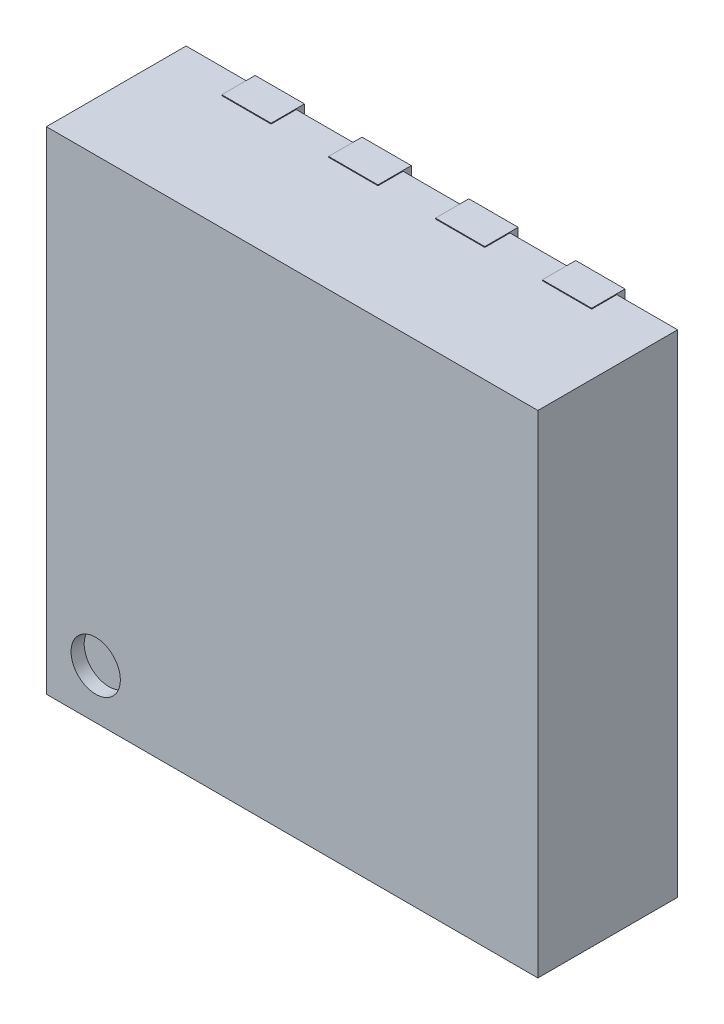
ISO-10303-21;
HEADER;
FILE_DESCRIPTION(('STEP AP214'),'2;1');
FILE_NAME('part.step','',(''),(''),'','','');
FILE_SCHEMA(('AUTOMOTIVE_DESIGN { 1 0 10303 214 1 1 1 1 }'));
ENDSEC;
DATA;
#1=APPLICATION_CONTEXT('core data for automotive mechanical design processes');
#2=APPLICATION_PROTOCOL_DEFINITION('international standard','automotive_design',2000,#1);
#3=PRODUCT_CONTEXT('',#1,'mechanical');
#4=PRODUCT('Part','Part','',(#3));
#5=PRODUCT_RELATED_PRODUCT_CATEGORY('part','',(#4));
#6=PRODUCT_DEFINITION_FORMATION('','',#4);
#7=PRODUCT_DEFINITION_CONTEXT('part definition',#1,'design');
#8=PRODUCT_DEFINITION('design','',#6,#7);
#9=PRODUCT_DEFINITION_SHAPE('','',#8);
#10=(LENGTH_UNIT() NAMED_UNIT(*) SI_UNIT(.MILLI.,.METRE.));
#11=(NAMED_UNIT(*) PLANE_ANGLE_UNIT() SI_UNIT($,.RADIAN.));
#12=(NAMED_UNIT(*) SI_UNIT($,.STERADIAN.) SOLID_ANGLE_UNIT());
#13=UNCERTAINTY_MEASURE_WITH_UNIT(LENGTH_MEASURE(1.E-05),#10,'distance_accuracy_value','');
#14=(GEOMETRIC_REPRESENTATION_CONTEXT(3) GLOBAL_UNCERTAINTY_ASSIGNED_CONTEXT((#13)) GLOBAL_UNIT_ASSIGNED_CONTEXT((#10,
#11,#12)) REPRESENTATION_CONTEXT('',''));
#15=CARTESIAN_POINT('',(0.,0.,0.));
#16=DIRECTION('',(0.,0.,1.));
#17=DIRECTION('',(1.,0.,0.));
#18=AXIS2_PLACEMENT_3D('',#15,#16,#17);
#19=CARTESIAN_POINT('',(-1.195,-1.195,0.82));
#20=DIRECTION('',(0.,0.,1.));
#21=DIRECTION('',(1.,0.,0.));
#22=AXIS2_PLACEMENT_3D('',#19,#20,#21);
#23=PLANE('',#22);
#24=CARTESIAN_POINT('',(-1.195,-1.195,0.82));
#25=DIRECTION('',(0.,0.,1.));
#26=DIRECTION('',(1.,0.,0.));
#27=AXIS2_PLACEMENT_3D('',#24,#25,#26);
#28=CIRCLE('',#27,0.15);
#29=CARTESIAN_POINT('',(-1.045,-1.195,0.82));
#30=VERTEX_POINT('',#29);
#31=EDGE_CURVE('E1559',#30,#30,#28,.T.);
#32=ORIENTED_EDGE('',*,*,#31,.T.);
#33=EDGE_LOOP('',(#32));
#34=FACE_BOUND('',#33,.T.);
#35=ADVANCED_FACE('F17',(#34),#23,.T.);
#36=CARTESIAN_POINT('',(0.,0.,0.));
#37=DIRECTION('',(0.,0.,1.));
#38=DIRECTION('',(1.,0.,0.));
#39=AXIS2_PLACEMENT_3D('',#36,#37,#38);
#40=PLANE('',#39);
#41=DIRECTION('',(-1.,0.,0.));
#42=VECTOR('',#41,1.);
#43=CARTESIAN_POINT('',(-0.85,-0.75,0.));
#44=LINE('',#43,#42);
#45=CARTESIAN_POINT('',(1.15,-0.75,0.));
#46=VERTEX_POINT('',#45);
#47=CARTESIAN_POINT('',(-0.85,-0.75,0.));
#48=VERTEX_POINT('',#47);
#49=EDGE_CURVE('E11',#46,#48,#44,.T.);
#50=ORIENTED_EDGE('',*,*,#49,.T.);
#51=DIRECTION('',(-0.707106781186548,0.707106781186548,0.));
#52=VECTOR('',#51,1.);
#53=CARTESIAN_POINT('',(-1.15,-0.45,0.));
#54=LINE('',#53,#52);
#55=CARTESIAN_POINT('',(-1.15,-0.45,0.));
#56=VERTEX_POINT('',#55);
#57=EDGE_CURVE('E44',#48,#56,#54,.T.);
#58=ORIENTED_EDGE('',*,*,#57,.T.);
#59=DIRECTION('',(0.,1.,0.));
#60=VECTOR('',#59,1.);
#61=CARTESIAN_POINT('',(-1.15,0.75,0.));
#62=LINE('',#61,#60);
#63=CARTESIAN_POINT('',(-1.15,0.75,0.));
#64=VERTEX_POINT('',#63);
#65=EDGE_CURVE('E1364',#56,#64,#62,.T.);
#66=ORIENTED_EDGE('',*,*,#65,.T.);
#67=DIRECTION('',(1.,0.,0.));
#68=VECTOR('',#67,1.);
#69=CARTESIAN_POINT('',(-1.15,0.75,0.));
#70=LINE('',#69,#68);
#71=CARTESIAN_POINT('',(1.15,0.75,0.));
#72=VERTEX_POINT('',#71);
#73=EDGE_CURVE('E1357',#64,#72,#70,.T.);
#74=ORIENTED_EDGE('',*,*,#73,.T.);
#75=DIRECTION('',(0.,1.,0.));
#76=VECTOR('',#75,1.);
#77=CARTESIAN_POINT('',(1.15,0.,0.));
#78=LINE('',#77,#76);
#79=EDGE_CURVE('E811',#46,#72,#78,.T.);
#80=ORIENTED_EDGE('',*,*,#79,.F.);
#81=EDGE_LOOP('',(#50,#58,#66,#74,#80));
#82=FACE_BOUND('',#81,.T.);
#83=ADVANCED_FACE('F1385',(#82),#40,.F.);
#84=CARTESIAN_POINT('',(-0.85,-0.75,0.203));
#85=DIRECTION('',(0.,1.,0.));
#86=DIRECTION('',(1.,0.,0.));
#87=AXIS2_PLACEMENT_3D('',#84,#85,#86);
#88=PLANE('',#87);
#89=DIRECTION('',(-1.,0.,0.));
#90=VECTOR('',#89,1.);
#91=CARTESIAN_POINT('',(0.,-0.75,0.05));
#92=LINE('',#91,#90);
#93=CARTESIAN_POINT('',(1.15,-0.75,0.05));
#94=VERTEX_POINT('',#93);
#95=CARTESIAN_POINT('',(-0.85,-0.75,0.05));
#96=VERTEX_POINT('',#95);
#97=EDGE_CURVE('E858',#94,#96,#92,.T.);
#98=ORIENTED_EDGE('',*,*,#97,.T.);
#99=DIRECTION('',(0.,0.,-1.));
#100=VECTOR('',#99,1.);
#101=CARTESIAN_POINT('',(-0.85,-0.75,0.203));
#102=LINE('',#101,#100);
#103=EDGE_CURVE('E25',#96,#48,#102,.T.);
#104=ORIENTED_EDGE('',*,*,#103,.T.);
#105=ORIENTED_EDGE('',*,*,#49,.F.);
#106=DIRECTION('',(0.,0.,1.));
#107=VECTOR('',#106,1.);
#108=CARTESIAN_POINT('',(1.15,-0.75,0.203));
#109=LINE('',#108,#107);
#110=EDGE_CURVE('E808',#46,#94,#109,.T.);
#111=ORIENTED_EDGE('',*,*,#110,.T.);
#112=EDGE_LOOP('',(#98,#104,#105,#111));
#113=FACE_BOUND('',#112,.T.);
#114=ADVANCED_FACE('F1375',(#113),#88,.F.);
#115=CARTESIAN_POINT('',(-1.15,-0.45,0.203));
#116=DIRECTION('',(0.707106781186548,0.707106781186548,0.));
#117=DIRECTION('',(0.,0.,-1.));
#118=AXIS2_PLACEMENT_3D('',#115,#116,#117);
#119=PLANE('',#118);
#120=DIRECTION('',(-0.707106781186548,0.707106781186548,0.));
#121=VECTOR('',#120,1.);
#122=CARTESIAN_POINT('',(-0.85,-0.75,0.05));
#123=LINE('',#122,#121);
#124=CARTESIAN_POINT('',(-1.15,-0.45,0.05));
#125=VERTEX_POINT('',#124);
#126=EDGE_CURVE('E863',#96,#125,#123,.T.);
#127=ORIENTED_EDGE('',*,*,#126,.T.);
#128=DIRECTION('',(0.,0.,-1.));
#129=VECTOR('',#128,1.);
#130=CARTESIAN_POINT('',(-1.15,-0.45,0.203));
#131=LINE('',#130,#129);
#132=EDGE_CURVE('E1367',#125,#56,#131,.T.);
#133=ORIENTED_EDGE('',*,*,#132,.T.);
#134=ORIENTED_EDGE('',*,*,#57,.F.);
#135=ORIENTED_EDGE('',*,*,#103,.F.);
#136=EDGE_LOOP('',(#127,#133,#134,#135));
#137=FACE_BOUND('',#136,.T.);
#138=ADVANCED_FACE('F1379',(#137),#119,.F.);
#139=CARTESIAN_POINT('',(-1.15,0.75,0.203));
#140=DIRECTION('',(1.,0.,0.));
#141=DIRECTION('',(0.,1.,0.));
#142=AXIS2_PLACEMENT_3D('',#139,#140,#141);
#143=PLANE('',#142);
#144=DIRECTION('',(0.,1.,0.));
#145=VECTOR('',#144,1.);
#146=CARTESIAN_POINT('',(-1.15,0.,0.05));
#147=LINE('',#146,#145);
#148=CARTESIAN_POINT('',(-1.15,0.75,0.05));
#149=VERTEX_POINT('',#148);
#150=EDGE_CURVE('E1019',#125,#149,#147,.T.);
#151=ORIENTED_EDGE('',*,*,#150,.T.);
#152=DIRECTION('',(0.,0.,-1.));
#153=VECTOR('',#152,1.);
#154=CARTESIAN_POINT('',(-1.15,0.75,0.203));
#155=LINE('',#154,#153);
#156=EDGE_CURVE('E1360',#149,#64,#155,.T.);
#157=ORIENTED_EDGE('',*,*,#156,.T.);
#158=ORIENTED_EDGE('',*,*,#65,.F.);
#159=ORIENTED_EDGE('',*,*,#132,.F.);
#160=EDGE_LOOP('',(#151,#157,#158,#159));
#161=FACE_BOUND('',#160,.T.);
#162=ADVANCED_FACE('F1383',(#161),#143,.F.);
#163=CARTESIAN_POINT('',(-1.15,0.75,0.203));
#164=DIRECTION('',(0.,-1.,0.));
#165=DIRECTION('',(0.,0.,-1.));
#166=AXIS2_PLACEMENT_3D('',#163,#164,#165);
#167=PLANE('',#166);
#168=DIRECTION('',(1.,0.,0.));
#169=VECTOR('',#168,1.);
#170=CARTESIAN_POINT('',(0.,0.75,0.05));
#171=LINE('',#170,#169);
#172=CARTESIAN_POINT('',(1.15,0.75,0.05));
#173=VERTEX_POINT('',#172);
#174=EDGE_CURVE('E1015',#149,#173,#171,.T.);
#175=ORIENTED_EDGE('',*,*,#174,.T.);
#176=DIRECTION('',(0.,0.,-1.));
#177=VECTOR('',#176,1.);
#178=CARTESIAN_POINT('',(1.15,0.75,0.203));
#179=LINE('',#178,#177);
#180=EDGE_CURVE('E1353',#173,#72,#179,.T.);
#181=ORIENTED_EDGE('',*,*,#180,.T.);
#182=ORIENTED_EDGE('',*,*,#73,.F.);
#183=ORIENTED_EDGE('',*,*,#156,.F.);
#184=EDGE_LOOP('',(#175,#181,#182,#183));
#185=FACE_BOUND('',#184,.T.);
#186=ADVANCED_FACE('F1388',(#185),#167,.F.);
#187=CARTESIAN_POINT('',(1.15,0.75,0.203));
#188=DIRECTION('',(-1.,0.,0.));
#189=DIRECTION('',(0.,0.,1.));
#190=AXIS2_PLACEMENT_3D('',#187,#188,#189);
#191=PLANE('',#190);
#192=DIRECTION('',(0.,-1.,0.));
#193=VECTOR('',#192,1.);
#194=CARTESIAN_POINT('',(1.15,0.,0.05));
#195=LINE('',#194,#193);
#196=EDGE_CURVE('E862',#173,#94,#195,.T.);
#197=ORIENTED_EDGE('',*,*,#196,.T.);
#198=ORIENTED_EDGE('',*,*,#110,.F.);
#199=ORIENTED_EDGE('',*,*,#79,.T.);
#200=ORIENTED_EDGE('',*,*,#180,.F.);
#201=EDGE_LOOP('',(#197,#198,#199,#200));
#202=FACE_BOUND('',#201,.T.);
#203=ADVANCED_FACE('F1392',(#202),#191,.F.);
#204=CARTESIAN_POINT('',(-1.125,1.5,0.203));
#205=DIRECTION('',(0.,-1.,0.));
#206=DIRECTION('',(0.,0.,-1.));
#207=AXIS2_PLACEMENT_3D('',#204,#205,#206);
#208=PLANE('',#207);
#209=DIRECTION('',(0.,0.,1.));
#210=VECTOR('',#209,1.);
#211=CARTESIAN_POINT('',(-1.125,1.5,0.203));
#212=LINE('',#211,#210);
#213=CARTESIAN_POINT('',(-1.125,1.5,0.));
#214=VERTEX_POINT('',#213);
#215=CARTESIAN_POINT('',(-1.125,1.5,0.203));
#216=VERTEX_POINT('',#215);
#217=EDGE_CURVE('E1323',#214,#216,#212,.T.);
#218=ORIENTED_EDGE('',*,*,#217,.T.);
#219=DIRECTION('',(1.,0.,0.));
#220=VECTOR('',#219,1.);
#221=CARTESIAN_POINT('',(-0.895,1.5,0.203));
#222=LINE('',#221,#220);
#223=CARTESIAN_POINT('',(-0.825,1.5,0.203));
#224=VERTEX_POINT('',#223);
#225=EDGE_CURVE('E1318',#216,#224,#222,.T.);
#226=ORIENTED_EDGE('',*,*,#225,.T.);
#227=DIRECTION('',(0.,0.,-1.));
#228=VECTOR('',#227,1.);
#229=CARTESIAN_POINT('',(-0.825,1.5,0.203));
#230=LINE('',#229,#228);
#231=CARTESIAN_POINT('',(-0.825,1.5,0.));
#232=VERTEX_POINT('',#231);
#233=EDGE_CURVE('E1310',#224,#232,#230,.T.);
#234=ORIENTED_EDGE('',*,*,#233,.T.);
#235=DIRECTION('',(1.,0.,0.));
#236=VECTOR('',#235,1.);
#237=CARTESIAN_POINT('',(-0.895,1.5,0.));
#238=LINE('',#237,#236);
#239=EDGE_CURVE('E812',#214,#232,#238,.T.);
#240=ORIENTED_EDGE('',*,*,#239,.F.);
#241=EDGE_LOOP('',(#218,#226,#234,#240));
#242=FACE_BOUND('',#241,.T.);
#243=ADVANCED_FACE('F1583',(#242),#208,.F.);
#244=CARTESIAN_POINT('',(-0.895,1.27,0.));
#245=DIRECTION('',(0.,0.,-1.));
#246=DIRECTION('',(0.,-1.,0.));
#247=AXIS2_PLACEMENT_3D('',#244,#245,#246);
#248=PLANE('',#247);
#249=CARTESIAN_POINT('',(-1.055,1.27,0.));
#250=DIRECTION('',(0.,0.,1.));
#251=DIRECTION('',(-1.,0.,0.));
#252=AXIS2_PLACEMENT_3D('',#249,#250,#251);
#253=CIRCLE('',#252,0.07);
#254=CARTESIAN_POINT('',(-1.125,1.27,0.));
#255=VERTEX_POINT('',#254);
#256=CARTESIAN_POINT('',(-1.055,1.2,0.));
#257=VERTEX_POINT('',#256);
#258=EDGE_CURVE('E1334',#255,#257,#253,.T.);
#259=ORIENTED_EDGE('',*,*,#258,.F.);
#260=DIRECTION('',(0.,1.,0.));
#261=VECTOR('',#260,1.);
#262=CARTESIAN_POINT('',(-1.125,1.5,0.));
#263=LINE('',#262,#261);
#264=EDGE_CURVE('E1326',#255,#214,#263,.T.);
#265=ORIENTED_EDGE('',*,*,#264,.T.);
#266=ORIENTED_EDGE('',*,*,#239,.T.);
#267=DIRECTION('',(0.,-1.,0.));
#268=VECTOR('',#267,1.);
#269=CARTESIAN_POINT('',(-0.825,1.5,0.));
#270=LINE('',#269,#268);
#271=CARTESIAN_POINT('',(-0.825,1.27,0.));
#272=VERTEX_POINT('',#271);
#273=EDGE_CURVE('E1306',#232,#272,#270,.T.);
#274=ORIENTED_EDGE('',*,*,#273,.T.);
#275=CARTESIAN_POINT('',(-0.895,1.27,0.));
#276=DIRECTION('',(0.,0.,1.));
#277=DIRECTION('',(-1.,0.,0.));
#278=AXIS2_PLACEMENT_3D('',#275,#276,#277);
#279=CIRCLE('',#278,0.07);
#280=CARTESIAN_POINT('',(-0.895,1.2,0.));
#281=VERTEX_POINT('',#280);
#282=EDGE_CURVE('E911',#281,#272,#279,.T.);
#283=ORIENTED_EDGE('',*,*,#282,.F.);
#284=DIRECTION('',(-1.,0.,0.));
#285=VECTOR('',#284,1.);
#286=CARTESIAN_POINT('',(-1.055,1.2,0.));
#287=LINE('',#286,#285);
#288=EDGE_CURVE('E1341',#281,#257,#287,.T.);
#289=ORIENTED_EDGE('',*,*,#288,.T.);
#290=EDGE_LOOP('',(#259,#265,#266,#274,#283,#289));
#291=FACE_BOUND('',#290,.T.);
#292=ADVANCED_FACE('F1588',(#291),#248,.T.);
#293=CARTESIAN_POINT('',(-0.895,1.27,0.203));
#294=DIRECTION('',(0.,0.,-1.));
#295=DIRECTION('',(-0.707106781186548,0.707106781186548,0.));
#296=AXIS2_PLACEMENT_3D('',#293,#294,#295);
#297=CYLINDRICAL_SURFACE('',#296,0.07);
#298=ORIENTED_EDGE('',*,*,#282,.T.);
#299=DIRECTION('',(0.,0.,1.));
#300=VECTOR('',#299,1.);
#301=CARTESIAN_POINT('',(-0.825,1.27,0.203));
#302=LINE('',#301,#300);
#303=CARTESIAN_POINT('',(-0.825,1.27,0.05));
#304=VERTEX_POINT('',#303);
#305=EDGE_CURVE('E1303',#272,#304,#302,.T.);
#306=ORIENTED_EDGE('',*,*,#305,.T.);
#307=CARTESIAN_POINT('',(-0.895,1.27,0.05));
#308=DIRECTION('',(0.,0.,-1.));
#309=DIRECTION('',(-1.,0.,0.));
#310=AXIS2_PLACEMENT_3D('',#307,#308,#309);
#311=CIRCLE('',#310,0.07);
#312=CARTESIAN_POINT('',(-0.895,1.2,0.05));
#313=VERTEX_POINT('',#312);
#314=EDGE_CURVE('E871',#304,#313,#311,.T.);
#315=ORIENTED_EDGE('',*,*,#314,.T.);
#316=DIRECTION('',(0.,0.,-1.));
#317=VECTOR('',#316,1.);
#318=CARTESIAN_POINT('',(-0.895,1.2,0.203));
#319=LINE('',#318,#317);
#320=EDGE_CURVE('E1344',#313,#281,#319,.T.);
#321=ORIENTED_EDGE('',*,*,#320,.T.);
#322=EDGE_LOOP('',(#298,#306,#315,#321));
#323=FACE_BOUND('',#322,.T.);
#324=ADVANCED_FACE('F1533',(#323),#297,.T.);
#325=CARTESIAN_POINT('',(-1.055,1.2,0.203));
#326=DIRECTION('',(0.,1.,0.));
#327=DIRECTION('',(1.,0.,0.));
#328=AXIS2_PLACEMENT_3D('',#325,#326,#327);
#329=PLANE('',#328);
#330=DIRECTION('',(0.,0.,1.));
#331=VECTOR('',#330,1.);
#332=CARTESIAN_POINT('',(-1.055,1.2,0.203));
#333=LINE('',#332,#331);
#334=CARTESIAN_POINT('',(-1.055,1.2,0.05));
#335=VERTEX_POINT('',#334);
#336=EDGE_CURVE('E1338',#257,#335,#333,.T.);
#337=ORIENTED_EDGE('',*,*,#336,.F.);
#338=ORIENTED_EDGE('',*,*,#288,.F.);
#339=ORIENTED_EDGE('',*,*,#320,.F.);
#340=DIRECTION('',(-1.,0.,0.));
#341=VECTOR('',#340,1.);
#342=CARTESIAN_POINT('',(0.,1.2,0.05));
#343=LINE('',#342,#341);
#344=EDGE_CURVE('E867',#313,#335,#343,.T.);
#345=ORIENTED_EDGE('',*,*,#344,.T.);
#346=EDGE_LOOP('',(#337,#338,#339,#345));
#347=FACE_BOUND('',#346,.T.);
#348=ADVANCED_FACE('F1531',(#347),#329,.F.);
#349=CARTESIAN_POINT('',(-1.055,1.27,0.203));
#350=DIRECTION('',(0.,0.,-1.));
#351=DIRECTION('',(0.707106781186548,0.707106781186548,0.));
#352=AXIS2_PLACEMENT_3D('',#349,#350,#351);
#353=CYLINDRICAL_SURFACE('',#352,0.07);
#354=ORIENTED_EDGE('',*,*,#258,.T.);
#355=ORIENTED_EDGE('',*,*,#336,.T.);
#356=CARTESIAN_POINT('',(-1.055,1.27,0.05));
#357=DIRECTION('',(0.,0.,-1.));
#358=DIRECTION('',(-1.,0.,0.));
#359=AXIS2_PLACEMENT_3D('',#356,#357,#358);
#360=CIRCLE('',#359,0.07);
#361=CARTESIAN_POINT('',(-1.125,1.27,0.05));
#362=VERTEX_POINT('',#361);
#363=EDGE_CURVE('E872',#335,#362,#360,.T.);
#364=ORIENTED_EDGE('',*,*,#363,.T.);
#365=DIRECTION('',(0.,0.,-1.));
#366=VECTOR('',#365,1.);
#367=CARTESIAN_POINT('',(-1.125,1.27,0.203));
#368=LINE('',#367,#366);
#369=EDGE_CURVE('E1330',#362,#255,#368,.T.);
#370=ORIENTED_EDGE('',*,*,#369,.T.);
#371=EDGE_LOOP('',(#354,#355,#364,#370));
#372=FACE_BOUND('',#371,.T.);
#373=ADVANCED_FACE('F1527',(#372),#353,.T.);
#374=CARTESIAN_POINT('',(-1.125,1.5,0.203));
#375=DIRECTION('',(1.,0.,0.));
#376=DIRECTION('',(0.,1.,0.));
#377=AXIS2_PLACEMENT_3D('',#374,#375,#376);
#378=PLANE('',#377);
#379=DIRECTION('',(0.,1.,0.));
#380=VECTOR('',#379,1.);
#381=CARTESIAN_POINT('',(-1.125,1.27,0.203));
#382=LINE('',#381,#380);
#383=CARTESIAN_POINT('',(-1.125,1.495,0.203));
#384=VERTEX_POINT('',#383);
#385=EDGE_CURVE('E1319',#384,#216,#382,.T.);
#386=ORIENTED_EDGE('',*,*,#385,.T.);
#387=ORIENTED_EDGE('',*,*,#217,.F.);
#388=ORIENTED_EDGE('',*,*,#264,.F.);
#389=ORIENTED_EDGE('',*,*,#369,.F.);
#390=DIRECTION('',(0.,1.,0.));
#391=VECTOR('',#390,1.);
#392=CARTESIAN_POINT('',(-1.125,0.,0.05));
#393=LINE('',#392,#391);
#394=CARTESIAN_POINT('',(-1.125,1.495,0.05));
#395=VERTEX_POINT('',#394);
#396=EDGE_CURVE('E843',#362,#395,#393,.T.);
#397=ORIENTED_EDGE('',*,*,#396,.T.);
#398=DIRECTION('',(0.,0.,1.));
#399=VECTOR('',#398,1.);
#400=CARTESIAN_POINT('',(-1.125,1.495,0.9));
#401=LINE('',#400,#399);
#402=EDGE_CURVE('E719',#395,#384,#401,.T.);
#403=ORIENTED_EDGE('',*,*,#402,.T.);
#404=EDGE_LOOP('',(#386,#387,#388,#389,#397,#403));
#405=FACE_BOUND('',#404,.T.);
#406=ADVANCED_FACE('F1519',(#405),#378,.F.);
#407=CARTESIAN_POINT('',(-0.895,1.27,0.203));
#408=DIRECTION('',(0.,0.,-1.));
#409=DIRECTION('',(0.,-1.,0.));
#410=AXIS2_PLACEMENT_3D('',#407,#408,#409);
#411=PLANE('',#410);
#412=DIRECTION('',(0.,1.,0.));
#413=VECTOR('',#412,1.);
#414=CARTESIAN_POINT('',(-0.825,1.5,0.203));
#415=LINE('',#414,#413);
#416=CARTESIAN_POINT('',(-0.825,1.495,0.203));
#417=VERTEX_POINT('',#416);
#418=EDGE_CURVE('E1314',#417,#224,#415,.T.);
#419=ORIENTED_EDGE('',*,*,#418,.T.);
#420=ORIENTED_EDGE('',*,*,#225,.F.);
#421=ORIENTED_EDGE('',*,*,#385,.F.);
#422=DIRECTION('',(1.,0.,0.));
#423=VECTOR('',#422,1.);
#424=CARTESIAN_POINT('',(-1.495,1.495,0.203));
#425=LINE('',#424,#423);
#426=EDGE_CURVE('E715',#384,#417,#425,.T.);
#427=ORIENTED_EDGE('',*,*,#426,.T.);
#428=EDGE_LOOP('',(#419,#420,#421,#427));
#429=FACE_BOUND('',#428,.T.);
#430=ADVANCED_FACE('F1586',(#429),#411,.F.);
#431=CARTESIAN_POINT('',(-0.825,1.5,0.203));
#432=DIRECTION('',(-1.,0.,0.));
#433=DIRECTION('',(0.,0.,1.));
#434=AXIS2_PLACEMENT_3D('',#431,#432,#433);
#435=PLANE('',#434);
#436=DIRECTION('',(0.,-1.,0.));
#437=VECTOR('',#436,1.);
#438=CARTESIAN_POINT('',(-0.825,0.,0.05));
#439=LINE('',#438,#437);
#440=CARTESIAN_POINT('',(-0.825,1.495,0.05));
#441=VERTEX_POINT('',#440);
#442=EDGE_CURVE('E968',#441,#304,#439,.T.);
#443=ORIENTED_EDGE('',*,*,#442,.T.);
#444=ORIENTED_EDGE('',*,*,#305,.F.);
#445=ORIENTED_EDGE('',*,*,#273,.F.);
#446=ORIENTED_EDGE('',*,*,#233,.F.);
#447=ORIENTED_EDGE('',*,*,#418,.F.);
#448=DIRECTION('',(0.,0.,-1.));
#449=VECTOR('',#448,1.);
#450=CARTESIAN_POINT('',(-0.825,1.495,0.9));
#451=LINE('',#450,#449);
#452=EDGE_CURVE('E720',#417,#441,#451,.T.);
#453=ORIENTED_EDGE('',*,*,#452,.T.);
#454=EDGE_LOOP('',(#443,#444,#445,#446,#447,#453));
#455=FACE_BOUND('',#454,.T.);
#456=ADVANCED_FACE('F1541',(#455),#435,.F.);
#457=CARTESIAN_POINT('',(-0.475,1.5,0.203));
#458=DIRECTION('',(0.,-1.,0.));
#459=DIRECTION('',(0.,0.,-1.));
#460=AXIS2_PLACEMENT_3D('',#457,#458,#459);
#461=PLANE('',#460);
#462=DIRECTION('',(0.,0.,1.));
#463=VECTOR('',#462,1.);
#464=CARTESIAN_POINT('',(-0.475,1.5,0.203));
#465=LINE('',#464,#463);
#466=CARTESIAN_POINT('',(-0.475,1.5,0.));
#467=VERTEX_POINT('',#466);
#468=CARTESIAN_POINT('',(-0.475,1.5,0.203));
#469=VERTEX_POINT('',#468);
#470=EDGE_CURVE('E1141',#467,#469,#465,.T.);
#471=ORIENTED_EDGE('',*,*,#470,.T.);
#472=DIRECTION('',(1.,0.,0.));
#473=VECTOR('',#472,1.);
#474=CARTESIAN_POINT('',(-0.245,1.5,0.203));
#475=LINE('',#474,#473);
#476=CARTESIAN_POINT('',(-0.175,1.5,0.203));
#477=VERTEX_POINT('',#476);
#478=EDGE_CURVE('E1142',#469,#477,#475,.T.);
#479=ORIENTED_EDGE('',*,*,#478,.T.);
#480=DIRECTION('',(0.,0.,-1.));
#481=VECTOR('',#480,1.);
#482=CARTESIAN_POINT('',(-0.175,1.5,0.203));
#483=LINE('',#482,#481);
#484=CARTESIAN_POINT('',(-0.175,1.5,0.));
#485=VERTEX_POINT('',#484);
#486=EDGE_CURVE('E1281',#477,#485,#483,.T.);
#487=ORIENTED_EDGE('',*,*,#486,.T.);
#488=DIRECTION('',(1.,0.,0.));
#489=VECTOR('',#488,1.);
#490=CARTESIAN_POINT('',(-0.245,1.5,0.));
#491=LINE('',#490,#489);
#492=EDGE_CURVE('E1121',#467,#485,#491,.T.);
#493=ORIENTED_EDGE('',*,*,#492,.F.);
#494=EDGE_LOOP('',(#471,#479,#487,#493));
#495=FACE_BOUND('',#494,.T.);
#496=ADVANCED_FACE('F1681',(#495),#461,.F.);
#497=CARTESIAN_POINT('',(-0.245,1.27,0.));
#498=DIRECTION('',(0.,0.,-1.));
#499=DIRECTION('',(0.,-1.,0.));
#500=AXIS2_PLACEMENT_3D('',#497,#498,#499);
#501=PLANE('',#500);
#502=CARTESIAN_POINT('',(-0.405,1.27,0.));
#503=DIRECTION('',(0.,0.,1.));
#504=DIRECTION('',(-1.,0.,0.));
#505=AXIS2_PLACEMENT_3D('',#502,#503,#504);
#506=CIRCLE('',#505,0.07);
#507=CARTESIAN_POINT('',(-0.475,1.27,0.));
#508=VERTEX_POINT('',#507);
#509=CARTESIAN_POINT('',(-0.405,1.2,0.));
#510=VERTEX_POINT('',#509);
#511=EDGE_CURVE('E957',#508,#510,#506,.T.);
#512=ORIENTED_EDGE('',*,*,#511,.F.);
#513=DIRECTION('',(0.,1.,0.));
#514=VECTOR('',#513,1.);
#515=CARTESIAN_POINT('',(-0.475,1.5,0.));
#516=LINE('',#515,#514);
#517=EDGE_CURVE('E1201',#508,#467,#516,.T.);
#518=ORIENTED_EDGE('',*,*,#517,.T.);
#519=ORIENTED_EDGE('',*,*,#492,.T.);
#520=DIRECTION('',(0.,-1.,0.));
#521=VECTOR('',#520,1.);
#522=CARTESIAN_POINT('',(-0.175,1.5,0.));
#523=LINE('',#522,#521);
#524=CARTESIAN_POINT('',(-0.175,1.27,0.));
#525=VERTEX_POINT('',#524);
#526=EDGE_CURVE('E1277',#485,#525,#523,.T.);
#527=ORIENTED_EDGE('',*,*,#526,.T.);
#528=CARTESIAN_POINT('',(-0.245,1.27,0.));
#529=DIRECTION('',(0.,0.,1.));
#530=DIRECTION('',(-1.,0.,0.));
#531=AXIS2_PLACEMENT_3D('',#528,#529,#530);
#532=CIRCLE('',#531,0.07);
#533=CARTESIAN_POINT('',(-0.245,1.2,0.));
#534=VERTEX_POINT('',#533);
#535=EDGE_CURVE('E1118',#534,#525,#532,.T.);
#536=ORIENTED_EDGE('',*,*,#535,.F.);
#537=DIRECTION('',(-1.,0.,0.));
#538=VECTOR('',#537,1.);
#539=CARTESIAN_POINT('',(-0.405,1.2,0.));
#540=LINE('',#539,#538);
#541=EDGE_CURVE('E697',#534,#510,#540,.T.);
#542=ORIENTED_EDGE('',*,*,#541,.T.);
#543=EDGE_LOOP('',(#512,#518,#519,#527,#536,#542));
#544=FACE_BOUND('',#543,.T.);
#545=ADVANCED_FACE('F1684',(#544),#501,.T.);
#546=CARTESIAN_POINT('',(-0.245,1.27,0.203));
#547=DIRECTION('',(0.,0.,-1.));
#548=DIRECTION('',(-0.707106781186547,0.707106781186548,0.));
#549=AXIS2_PLACEMENT_3D('',#546,#547,#548);
#550=CYLINDRICAL_SURFACE('',#549,0.07);
#551=DIRECTION('',(0.,0.,-1.));
#552=VECTOR('',#551,1.);
#553=CARTESIAN_POINT('',(-0.245,1.2,0.203));
#554=LINE('',#553,#552);
#555=CARTESIAN_POINT('',(-0.245,1.2,0.05));
#556=VERTEX_POINT('',#555);
#557=EDGE_CURVE('E700',#556,#534,#554,.T.);
#558=ORIENTED_EDGE('',*,*,#557,.T.);
#559=ORIENTED_EDGE('',*,*,#535,.T.);
#560=DIRECTION('',(0.,0.,1.));
#561=VECTOR('',#560,1.);
#562=CARTESIAN_POINT('',(-0.175,1.27,0.203));
#563=LINE('',#562,#561);
#564=CARTESIAN_POINT('',(-0.175,1.27,0.05));
#565=VERTEX_POINT('',#564);
#566=EDGE_CURVE('E1274',#525,#565,#563,.T.);
#567=ORIENTED_EDGE('',*,*,#566,.T.);
#568=CARTESIAN_POINT('',(-0.245,1.27,0.05));
#569=DIRECTION('',(0.,0.,-1.));
#570=DIRECTION('',(-1.,0.,0.));
#571=AXIS2_PLACEMENT_3D('',#568,#569,#570);
#572=CIRCLE('',#571,0.07);
#573=EDGE_CURVE('E983',#565,#556,#572,.T.);
#574=ORIENTED_EDGE('',*,*,#573,.T.);
#575=EDGE_LOOP('',(#558,#559,#567,#574));
#576=FACE_BOUND('',#575,.T.);
#577=ADVANCED_FACE('F1738',(#576),#550,.T.);
#578=CARTESIAN_POINT('',(-0.405,1.2,0.203));
#579=DIRECTION('',(0.,1.,0.));
#580=DIRECTION('',(1.,0.,0.));
#581=AXIS2_PLACEMENT_3D('',#578,#579,#580);
#582=PLANE('',#581);
#583=DIRECTION('',(-1.,0.,0.));
#584=VECTOR('',#583,1.);
#585=CARTESIAN_POINT('',(0.,1.2,0.05));
#586=LINE('',#585,#584);
#587=CARTESIAN_POINT('',(-0.405,1.2,0.05));
#588=VERTEX_POINT('',#587);
#589=EDGE_CURVE('E982',#556,#588,#586,.T.);
#590=ORIENTED_EDGE('',*,*,#589,.T.);
#591=DIRECTION('',(0.,0.,1.));
#592=VECTOR('',#591,1.);
#593=CARTESIAN_POINT('',(-0.405,1.2,0.203));
#594=LINE('',#593,#592);
#595=EDGE_CURVE('E701',#510,#588,#594,.T.);
#596=ORIENTED_EDGE('',*,*,#595,.F.);
#597=ORIENTED_EDGE('',*,*,#541,.F.);
#598=ORIENTED_EDGE('',*,*,#557,.F.);
#599=EDGE_LOOP('',(#590,#596,#597,#598));
#600=FACE_BOUND('',#599,.T.);
#601=ADVANCED_FACE('F1741',(#600),#582,.F.);
#602=CARTESIAN_POINT('',(-0.405,1.27,0.203));
#603=DIRECTION('',(0.,0.,-1.));
#604=DIRECTION('',(0.707106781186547,0.707106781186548,0.));
#605=AXIS2_PLACEMENT_3D('',#602,#603,#604);
#606=CYLINDRICAL_SURFACE('',#605,0.07);
#607=DIRECTION('',(0.,0.,-1.));
#608=VECTOR('',#607,1.);
#609=CARTESIAN_POINT('',(-0.475,1.27,0.203));
#610=LINE('',#609,#608);
#611=CARTESIAN_POINT('',(-0.475,1.27,0.05));
#612=VERTEX_POINT('',#611);
#613=EDGE_CURVE('E961',#612,#508,#610,.T.);
#614=ORIENTED_EDGE('',*,*,#613,.T.);
#615=ORIENTED_EDGE('',*,*,#511,.T.);
#616=ORIENTED_EDGE('',*,*,#595,.T.);
#617=CARTESIAN_POINT('',(-0.405,1.27,0.05));
#618=DIRECTION('',(0.,0.,-1.));
#619=DIRECTION('',(-1.,0.,0.));
#620=AXIS2_PLACEMENT_3D('',#617,#618,#619);
#621=CIRCLE('',#620,0.07);
#622=EDGE_CURVE('E978',#588,#612,#621,.T.);
#623=ORIENTED_EDGE('',*,*,#622,.T.);
#624=EDGE_LOOP('',(#614,#615,#616,#623));
#625=FACE_BOUND('',#624,.T.);
#626=ADVANCED_FACE('F1768',(#625),#606,.T.);
#627=CARTESIAN_POINT('',(-0.475,1.5,0.203));
#628=DIRECTION('',(1.,0.,0.));
#629=DIRECTION('',(0.,1.,0.));
#630=AXIS2_PLACEMENT_3D('',#627,#628,#629);
#631=PLANE('',#630);
#632=DIRECTION('',(0.,1.,0.));
#633=VECTOR('',#632,1.);
#634=CARTESIAN_POINT('',(-0.475,0.,0.05));
#635=LINE('',#634,#633);
#636=CARTESIAN_POINT('',(-0.475,1.495,0.05));
#637=VERTEX_POINT('',#636);
#638=EDGE_CURVE('E972',#612,#637,#635,.T.);
#639=ORIENTED_EDGE('',*,*,#638,.T.);
#640=DIRECTION('',(0.,0.,1.));
#641=VECTOR('',#640,1.);
#642=CARTESIAN_POINT('',(-0.475,1.495,0.9));
#643=LINE('',#642,#641);
#644=CARTESIAN_POINT('',(-0.475,1.495,0.203));
#645=VERTEX_POINT('',#644);
#646=EDGE_CURVE('E687',#637,#645,#643,.T.);
#647=ORIENTED_EDGE('',*,*,#646,.T.);
#648=DIRECTION('',(0.,1.,0.));
#649=VECTOR('',#648,1.);
#650=CARTESIAN_POINT('',(-0.475,1.27,0.203));
#651=LINE('',#650,#649);
#652=EDGE_CURVE('E1137',#645,#469,#651,.T.);
#653=ORIENTED_EDGE('',*,*,#652,.T.);
#654=ORIENTED_EDGE('',*,*,#470,.F.);
#655=ORIENTED_EDGE('',*,*,#517,.F.);
#656=ORIENTED_EDGE('',*,*,#613,.F.);
#657=EDGE_LOOP('',(#639,#647,#653,#654,#655,#656));
#658=FACE_BOUND('',#657,.T.);
#659=ADVANCED_FACE('F1764',(#658),#631,.F.);
#660=CARTESIAN_POINT('',(-0.245,1.27,0.203));
#661=DIRECTION('',(0.,0.,-1.));
#662=DIRECTION('',(0.,-1.,0.));
#663=AXIS2_PLACEMENT_3D('',#660,#661,#662);
#664=PLANE('',#663);
#665=DIRECTION('',(1.,0.,0.));
#666=VECTOR('',#665,1.);
#667=CARTESIAN_POINT('',(-1.495,1.495,0.203));
#668=LINE('',#667,#666);
#669=CARTESIAN_POINT('',(-0.175,1.495,0.203));
#670=VERTEX_POINT('',#669);
#671=EDGE_CURVE('E680',#645,#670,#668,.T.);
#672=ORIENTED_EDGE('',*,*,#671,.T.);
#673=DIRECTION('',(0.,1.,0.));
#674=VECTOR('',#673,1.);
#675=CARTESIAN_POINT('',(-0.175,1.5,0.203));
#676=LINE('',#675,#674);
#677=EDGE_CURVE('E1285',#670,#477,#676,.T.);
#678=ORIENTED_EDGE('',*,*,#677,.T.);
#679=ORIENTED_EDGE('',*,*,#478,.F.);
#680=ORIENTED_EDGE('',*,*,#652,.F.);
#681=EDGE_LOOP('',(#672,#678,#679,#680));
#682=FACE_BOUND('',#681,.T.);
#683=ADVANCED_FACE('F1761',(#682),#664,.F.);
#684=CARTESIAN_POINT('',(-0.175,1.5,0.203));
#685=DIRECTION('',(-1.,0.,0.));
#686=DIRECTION('',(0.,1.,0.));
#687=AXIS2_PLACEMENT_3D('',#684,#685,#686);
#688=PLANE('',#687);
#689=DIRECTION('',(0.,-1.,0.));
#690=VECTOR('',#689,1.);
#691=CARTESIAN_POINT('',(-0.175,0.,0.05));
#692=LINE('',#691,#690);
#693=CARTESIAN_POINT('',(-0.175,1.495,0.05));
#694=VERTEX_POINT('',#693);
#695=EDGE_CURVE('E817',#694,#565,#692,.T.);
#696=ORIENTED_EDGE('',*,*,#695,.T.);
#697=ORIENTED_EDGE('',*,*,#566,.F.);
#698=ORIENTED_EDGE('',*,*,#526,.F.);
#699=ORIENTED_EDGE('',*,*,#486,.F.);
#700=ORIENTED_EDGE('',*,*,#677,.F.);
#701=DIRECTION('',(0.,0.,-1.));
#702=VECTOR('',#701,1.);
#703=CARTESIAN_POINT('',(-0.175,1.495,0.9));
#704=LINE('',#703,#702);
#705=EDGE_CURVE('E676',#670,#694,#704,.T.);
#706=ORIENTED_EDGE('',*,*,#705,.T.);
#707=EDGE_LOOP('',(#696,#697,#698,#699,#700,#706));
#708=FACE_BOUND('',#707,.T.);
#709=ADVANCED_FACE('F1745',(#708),#688,.F.);
#710=CARTESIAN_POINT('',(0.175,1.5,0.203));
#711=DIRECTION('',(0.,-1.,0.));
#712=DIRECTION('',(0.,0.,-1.));
#713=AXIS2_PLACEMENT_3D('',#710,#711,#712);
#714=PLANE('',#713);
#715=DIRECTION('',(0.,0.,1.));
#716=VECTOR('',#715,1.);
#717=CARTESIAN_POINT('',(0.175,1.5,0.203));
#718=LINE('',#717,#716);
#719=CARTESIAN_POINT('',(0.175,1.5,0.));
#720=VERTEX_POINT('',#719);
#721=CARTESIAN_POINT('',(0.175,1.5,0.203));
#722=VERTEX_POINT('',#721);
#723=EDGE_CURVE('E839',#720,#722,#718,.T.);
#724=ORIENTED_EDGE('',*,*,#723,.T.);
#725=DIRECTION('',(1.,0.,0.));
#726=VECTOR('',#725,1.);
#727=CARTESIAN_POINT('',(0.405,1.5,0.203));
#728=LINE('',#727,#726);
#729=CARTESIAN_POINT('',(0.475,1.5,0.203));
#730=VERTEX_POINT('',#729);
#731=EDGE_CURVE('E1247',#722,#730,#728,.T.);
#732=ORIENTED_EDGE('',*,*,#731,.T.);
#733=DIRECTION('',(0.,0.,-1.));
#734=VECTOR('',#733,1.);
#735=CARTESIAN_POINT('',(0.475,1.5,0.203));
#736=LINE('',#735,#734);
#737=CARTESIAN_POINT('',(0.475,1.5,0.));
#738=VERTEX_POINT('',#737);
#739=EDGE_CURVE('E1068',#730,#738,#736,.T.);
#740=ORIENTED_EDGE('',*,*,#739,.T.);
#741=DIRECTION('',(1.,0.,0.));
#742=VECTOR('',#741,1.);
#743=CARTESIAN_POINT('',(0.405,1.5,0.));
#744=LINE('',#743,#742);
#745=EDGE_CURVE('E887',#720,#738,#744,.T.);
#746=ORIENTED_EDGE('',*,*,#745,.F.);
#747=EDGE_LOOP('',(#724,#732,#740,#746));
#748=FACE_BOUND('',#747,.T.);
#749=ADVANCED_FACE('F1691',(#748),#714,.F.);
#750=CARTESIAN_POINT('',(0.405,1.27,0.));
#751=DIRECTION('',(0.,0.,-1.));
#752=DIRECTION('',(0.,-1.,0.));
#753=AXIS2_PLACEMENT_3D('',#750,#751,#752);
#754=PLANE('',#753);
#755=CARTESIAN_POINT('',(0.245,1.27,0.));
#756=DIRECTION('',(0.,0.,1.));
#757=DIRECTION('',(-1.,0.,0.));
#758=AXIS2_PLACEMENT_3D('',#755,#756,#757);
#759=CIRCLE('',#758,0.07);
#760=CARTESIAN_POINT('',(0.175,1.27,0.));
#761=VERTEX_POINT('',#760);
#762=CARTESIAN_POINT('',(0.245,1.2,0.));
#763=VERTEX_POINT('',#762);
#764=EDGE_CURVE('E1259',#761,#763,#759,.T.);
#765=ORIENTED_EDGE('',*,*,#764,.F.);
#766=DIRECTION('',(0.,1.,0.));
#767=VECTOR('',#766,1.);
#768=CARTESIAN_POINT('',(0.175,1.5,0.));
#769=LINE('',#768,#767);
#770=EDGE_CURVE('E834',#761,#720,#769,.T.);
#771=ORIENTED_EDGE('',*,*,#770,.T.);
#772=ORIENTED_EDGE('',*,*,#745,.T.);
#773=DIRECTION('',(0.,-1.,0.));
#774=VECTOR('',#773,1.);
#775=CARTESIAN_POINT('',(0.475,1.5,0.));
#776=LINE('',#775,#774);
#777=CARTESIAN_POINT('',(0.475,1.27,0.));
#778=VERTEX_POINT('',#777);
#779=EDGE_CURVE('E902',#738,#778,#776,.T.);
#780=ORIENTED_EDGE('',*,*,#779,.T.);
#781=CARTESIAN_POINT('',(0.405,1.27,0.));
#782=DIRECTION('',(0.,0.,1.));
#783=DIRECTION('',(-1.,0.,0.));
#784=AXIS2_PLACEMENT_3D('',#781,#782,#783);
#785=CIRCLE('',#784,0.07);
#786=CARTESIAN_POINT('',(0.405,1.2,0.));
#787=VERTEX_POINT('',#786);
#788=EDGE_CURVE('E884',#787,#778,#785,.T.);
#789=ORIENTED_EDGE('',*,*,#788,.F.);
#790=DIRECTION('',(-1.,0.,0.));
#791=VECTOR('',#790,1.);
#792=CARTESIAN_POINT('',(0.245,1.2,0.));
#793=LINE('',#792,#791);
#794=EDGE_CURVE('E1266',#787,#763,#793,.T.);
#795=ORIENTED_EDGE('',*,*,#794,.T.);
#796=EDGE_LOOP('',(#765,#771,#772,#780,#789,#795));
#797=FACE_BOUND('',#796,.T.);
#798=ADVANCED_FACE('F1675',(#797),#754,.T.);
#799=CARTESIAN_POINT('',(0.405,1.27,0.203));
#800=DIRECTION('',(0.,0.,-1.));
#801=DIRECTION('',(-0.707106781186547,0.707106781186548,0.));
#802=AXIS2_PLACEMENT_3D('',#799,#800,#801);
#803=CYLINDRICAL_SURFACE('',#802,0.07);
#804=DIRECTION('',(0.,0.,-1.));
#805=VECTOR('',#804,1.);
#806=CARTESIAN_POINT('',(0.405,1.2,0.203));
#807=LINE('',#806,#805);
#808=CARTESIAN_POINT('',(0.405,1.2,0.05));
#809=VERTEX_POINT('',#808);
#810=EDGE_CURVE('E888',#809,#787,#807,.T.);
#811=ORIENTED_EDGE('',*,*,#810,.T.);
#812=ORIENTED_EDGE('',*,*,#788,.T.);
#813=DIRECTION('',(0.,0.,1.));
#814=VECTOR('',#813,1.);
#815=CARTESIAN_POINT('',(0.475,1.27,0.203));
#816=LINE('',#815,#814);
#817=CARTESIAN_POINT('',(0.475,1.27,0.05));
#818=VERTEX_POINT('',#817);
#819=EDGE_CURVE('E899',#778,#818,#816,.T.);
#820=ORIENTED_EDGE('',*,*,#819,.T.);
#821=CARTESIAN_POINT('',(0.405,1.27,0.05));
#822=DIRECTION('',(0.,0.,-1.));
#823=DIRECTION('',(-1.,0.,0.));
#824=AXIS2_PLACEMENT_3D('',#821,#822,#823);
#825=CIRCLE('',#824,0.07);
#826=EDGE_CURVE('E807',#818,#809,#825,.T.);
#827=ORIENTED_EDGE('',*,*,#826,.T.);
#828=EDGE_LOOP('',(#811,#812,#820,#827));
#829=FACE_BOUND('',#828,.T.);
#830=ADVANCED_FACE('F1671',(#829),#803,.T.);
#831=CARTESIAN_POINT('',(0.245,1.2,0.203));
#832=DIRECTION('',(0.,1.,0.));
#833=DIRECTION('',(1.,0.,0.));
#834=AXIS2_PLACEMENT_3D('',#831,#832,#833);
#835=PLANE('',#834);
#836=DIRECTION('',(-1.,0.,0.));
#837=VECTOR('',#836,1.);
#838=CARTESIAN_POINT('',(0.,1.2,0.05));
#839=LINE('',#838,#837);
#840=CARTESIAN_POINT('',(0.245,1.2,0.05));
#841=VERTEX_POINT('',#840);
#842=EDGE_CURVE('E990',#809,#841,#839,.T.);
#843=ORIENTED_EDGE('',*,*,#842,.T.);
#844=DIRECTION('',(0.,0.,1.));
#845=VECTOR('',#844,1.);
#846=CARTESIAN_POINT('',(0.245,1.2,0.203));
#847=LINE('',#846,#845);
#848=EDGE_CURVE('E1263',#763,#841,#847,.T.);
#849=ORIENTED_EDGE('',*,*,#848,.F.);
#850=ORIENTED_EDGE('',*,*,#794,.F.);
#851=ORIENTED_EDGE('',*,*,#810,.F.);
#852=EDGE_LOOP('',(#843,#849,#850,#851));
#853=FACE_BOUND('',#852,.T.);
#854=ADVANCED_FACE('F1674',(#853),#835,.F.);
#855=CARTESIAN_POINT('',(0.245,1.27,0.203));
#856=DIRECTION('',(0.,0.,-1.));
#857=DIRECTION('',(0.707106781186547,0.707106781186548,0.));
#858=AXIS2_PLACEMENT_3D('',#855,#856,#857);
#859=CYLINDRICAL_SURFACE('',#858,0.07);
#860=DIRECTION('',(0.,0.,-1.));
#861=VECTOR('',#860,1.);
#862=CARTESIAN_POINT('',(0.175,1.27,0.203));
#863=LINE('',#862,#861);
#864=CARTESIAN_POINT('',(0.175,1.27,0.05));
#865=VERTEX_POINT('',#864);
#866=EDGE_CURVE('E838',#865,#761,#863,.T.);
#867=ORIENTED_EDGE('',*,*,#866,.T.);
#868=ORIENTED_EDGE('',*,*,#764,.T.);
#869=ORIENTED_EDGE('',*,*,#848,.T.);
#870=CARTESIAN_POINT('',(0.245,1.27,0.05));
#871=DIRECTION('',(0.,0.,-1.));
#872=DIRECTION('',(-1.,0.,0.));
#873=AXIS2_PLACEMENT_3D('',#870,#871,#872);
#874=CIRCLE('',#873,0.07);
#875=EDGE_CURVE('E816',#841,#865,#874,.T.);
#876=ORIENTED_EDGE('',*,*,#875,.T.);
#877=EDGE_LOOP('',(#867,#868,#869,#876));
#878=FACE_BOUND('',#877,.T.);
#879=ADVANCED_FACE('F1711',(#878),#859,.T.);
#880=CARTESIAN_POINT('',(0.175,1.5,0.203));
#881=DIRECTION('',(1.,0.,0.));
#882=DIRECTION('',(0.,1.,0.));
#883=AXIS2_PLACEMENT_3D('',#880,#881,#882);
#884=PLANE('',#883);
#885=DIRECTION('',(0.,1.,0.));
#886=VECTOR('',#885,1.);
#887=CARTESIAN_POINT('',(0.175,0.,0.05));
#888=LINE('',#887,#886);
#889=CARTESIAN_POINT('',(0.175,1.495,0.05));
#890=VERTEX_POINT('',#889);
#891=EDGE_CURVE('E813',#865,#890,#888,.T.);
#892=ORIENTED_EDGE('',*,*,#891,.T.);
#893=DIRECTION('',(0.,0.,1.));
#894=VECTOR('',#893,1.);
#895=CARTESIAN_POINT('',(0.175,1.495,0.9));
#896=LINE('',#895,#894);
#897=CARTESIAN_POINT('',(0.175,1.495,0.203));
#898=VERTEX_POINT('',#897);
#899=EDGE_CURVE('E666',#890,#898,#896,.T.);
#900=ORIENTED_EDGE('',*,*,#899,.T.);
#901=DIRECTION('',(0.,1.,0.));
#902=VECTOR('',#901,1.);
#903=CARTESIAN_POINT('',(0.175,1.27,0.203));
#904=LINE('',#903,#902);
#905=EDGE_CURVE('E1250',#898,#722,#904,.T.);
#906=ORIENTED_EDGE('',*,*,#905,.T.);
#907=ORIENTED_EDGE('',*,*,#723,.F.);
#908=ORIENTED_EDGE('',*,*,#770,.F.);
#909=ORIENTED_EDGE('',*,*,#866,.F.);
#910=EDGE_LOOP('',(#892,#900,#906,#907,#908,#909));
#911=FACE_BOUND('',#910,.T.);
#912=ADVANCED_FACE('F1707',(#911),#884,.F.);
#913=CARTESIAN_POINT('',(0.405,1.27,0.203));
#914=DIRECTION('',(0.,0.,-1.));
#915=DIRECTION('',(0.,-1.,0.));
#916=AXIS2_PLACEMENT_3D('',#913,#914,#915);
#917=PLANE('',#916);
#918=DIRECTION('',(1.,0.,0.));
#919=VECTOR('',#918,1.);
#920=CARTESIAN_POINT('',(-1.495,1.495,0.203));
#921=LINE('',#920,#919);
#922=CARTESIAN_POINT('',(0.475,1.495,0.203));
#923=VERTEX_POINT('',#922);
#924=EDGE_CURVE('E671',#898,#923,#921,.T.);
#925=ORIENTED_EDGE('',*,*,#924,.T.);
#926=DIRECTION('',(0.,1.,0.));
#927=VECTOR('',#926,1.);
#928=CARTESIAN_POINT('',(0.475,1.5,0.203));
#929=LINE('',#928,#927);
#930=EDGE_CURVE('E1243',#923,#730,#929,.T.);
#931=ORIENTED_EDGE('',*,*,#930,.T.);
#932=ORIENTED_EDGE('',*,*,#731,.F.);
#933=ORIENTED_EDGE('',*,*,#905,.F.);
#934=EDGE_LOOP('',(#925,#931,#932,#933));
#935=FACE_BOUND('',#934,.T.);
#936=ADVANCED_FACE('F1710',(#935),#917,.F.);
#937=CARTESIAN_POINT('',(0.475,1.5,0.203));
#938=DIRECTION('',(-1.,0.,0.));
#939=DIRECTION('',(0.,1.,0.));
#940=AXIS2_PLACEMENT_3D('',#937,#938,#939);
#941=PLANE('',#940);
#942=DIRECTION('',(0.,-1.,0.));
#943=VECTOR('',#942,1.);
#944=CARTESIAN_POINT('',(0.475,0.,0.05));
#945=LINE('',#944,#943);
#946=CARTESIAN_POINT('',(0.475,1.495,0.05));
#947=VERTEX_POINT('',#946);
#948=EDGE_CURVE('E725',#947,#818,#945,.T.);
#949=ORIENTED_EDGE('',*,*,#948,.T.);
#950=ORIENTED_EDGE('',*,*,#819,.F.);
#951=ORIENTED_EDGE('',*,*,#779,.F.);
#952=ORIENTED_EDGE('',*,*,#739,.F.);
#953=ORIENTED_EDGE('',*,*,#930,.F.);
#954=DIRECTION('',(0.,0.,-1.));
#955=VECTOR('',#954,1.);
#956=CARTESIAN_POINT('',(0.475,1.495,0.9));
#957=LINE('',#956,#955);
#958=EDGE_CURVE('E664',#923,#947,#957,.T.);
#959=ORIENTED_EDGE('',*,*,#958,.T.);
#960=EDGE_LOOP('',(#949,#950,#951,#952,#953,#959));
#961=FACE_BOUND('',#960,.T.);
#962=ADVANCED_FACE('F1736',(#961),#941,.F.);
#963=CARTESIAN_POINT('',(1.055,1.27,0.203));
#964=DIRECTION('',(0.,0.,-1.));
#965=DIRECTION('',(-0.707106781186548,0.707106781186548,0.));
#966=AXIS2_PLACEMENT_3D('',#963,#964,#965);
#967=CYLINDRICAL_SURFACE('',#966,0.07);
#968=DIRECTION('',(0.,0.,-1.));
#969=VECTOR('',#968,1.);
#970=CARTESIAN_POINT('',(1.055,1.2,0.203));
#971=LINE('',#970,#969);
#972=CARTESIAN_POINT('',(1.055,1.2,0.05));
#973=VERTEX_POINT('',#972);
#974=CARTESIAN_POINT('',(1.055,1.2,0.));
#975=VERTEX_POINT('',#974);
#976=EDGE_CURVE('E903',#973,#975,#971,.T.);
#977=ORIENTED_EDGE('',*,*,#976,.T.);
#978=CARTESIAN_POINT('',(1.055,1.27,0.));
#979=DIRECTION('',(0.,0.,1.));
#980=DIRECTION('',(-1.,0.,0.));
#981=AXIS2_PLACEMENT_3D('',#978,#979,#980);
#982=CIRCLE('',#981,0.07);
#983=CARTESIAN_POINT('',(1.125,1.27,0.));
#984=VERTEX_POINT('',#983);
#985=EDGE_CURVE('E1235',#975,#984,#982,.T.);
#986=ORIENTED_EDGE('',*,*,#985,.T.);
#987=DIRECTION('',(0.,0.,1.));
#988=VECTOR('',#987,1.);
#989=CARTESIAN_POINT('',(1.125,1.27,0.203));
#990=LINE('',#989,#988);
#991=CARTESIAN_POINT('',(1.125,1.27,0.05));
#992=VERTEX_POINT('',#991);
#993=EDGE_CURVE('E1214',#984,#992,#990,.T.);
#994=ORIENTED_EDGE('',*,*,#993,.T.);
#995=CARTESIAN_POINT('',(1.055,1.27,0.05));
#996=DIRECTION('',(0.,0.,-1.));
#997=DIRECTION('',(-1.,0.,0.));
#998=AXIS2_PLACEMENT_3D('',#995,#996,#997);
#999=CIRCLE('',#998,0.07);
#1000=EDGE_CURVE('E724',#992,#973,#999,.T.);
#1001=ORIENTED_EDGE('',*,*,#1000,.T.);
#1002=EDGE_LOOP('',(#977,#986,#994,#1001));
#1003=FACE_BOUND('',#1002,.T.);
#1004=ADVANCED_FACE('F1732',(#1003),#967,.T.);
#1005=CARTESIAN_POINT('',(0.895,1.2,0.203));
#1006=DIRECTION('',(0.,1.,0.));
#1007=DIRECTION('',(1.,0.,0.));
#1008=AXIS2_PLACEMENT_3D('',#1005,#1006,#1007);
#1009=PLANE('',#1008);
#1010=DIRECTION('',(-1.,0.,0.));
#1011=VECTOR('',#1010,1.);
#1012=CARTESIAN_POINT('',(0.,1.2,0.05));
#1013=LINE('',#1012,#1011);
#1014=CARTESIAN_POINT('',(0.895,1.2,0.05));
#1015=VERTEX_POINT('',#1014);
#1016=EDGE_CURVE('E721',#973,#1015,#1013,.T.);
#1017=ORIENTED_EDGE('',*,*,#1016,.T.);
#1018=DIRECTION('',(0.,0.,1.));
#1019=VECTOR('',#1018,1.);
#1020=CARTESIAN_POINT('',(0.895,1.2,0.203));
#1021=LINE('',#1020,#1019);
#1022=CARTESIAN_POINT('',(0.895,1.2,0.));
#1023=VERTEX_POINT('',#1022);
#1024=EDGE_CURVE('E829',#1023,#1015,#1021,.T.);
#1025=ORIENTED_EDGE('',*,*,#1024,.F.);
#1026=DIRECTION('',(-1.,0.,0.));
#1027=VECTOR('',#1026,1.);
#1028=CARTESIAN_POINT('',(0.895,1.2,0.));
#1029=LINE('',#1028,#1027);
#1030=EDGE_CURVE('E999',#975,#1023,#1029,.T.);
#1031=ORIENTED_EDGE('',*,*,#1030,.F.);
#1032=ORIENTED_EDGE('',*,*,#976,.F.);
#1033=EDGE_LOOP('',(#1017,#1025,#1031,#1032));
#1034=FACE_BOUND('',#1033,.T.);
#1035=ADVANCED_FACE('F1728',(#1034),#1009,.F.);
#1036=CARTESIAN_POINT('',(1.055,1.27,0.));
#1037=DIRECTION('',(0.,0.,-1.));
#1038=DIRECTION('',(0.,-1.,0.));
#1039=AXIS2_PLACEMENT_3D('',#1036,#1037,#1038);
#1040=PLANE('',#1039);
#1041=CARTESIAN_POINT('',(0.895,1.27,0.));
#1042=DIRECTION('',(0.,0.,1.));
#1043=DIRECTION('',(-1.,0.,0.));
#1044=AXIS2_PLACEMENT_3D('',#1041,#1042,#1043);
#1045=CIRCLE('',#1044,0.07);
#1046=CARTESIAN_POINT('',(0.825,1.27,0.));
#1047=VERTEX_POINT('',#1046);
#1048=EDGE_CURVE('E825',#1047,#1023,#1045,.T.);
#1049=ORIENTED_EDGE('',*,*,#1048,.F.);
#1050=DIRECTION('',(0.,1.,0.));
#1051=VECTOR('',#1050,1.);
#1052=CARTESIAN_POINT('',(0.825,1.5,0.));
#1053=LINE('',#1052,#1051);
#1054=CARTESIAN_POINT('',(0.825,1.5,0.));
#1055=VERTEX_POINT('',#1054);
#1056=EDGE_CURVE('E803',#1047,#1055,#1053,.T.);
#1057=ORIENTED_EDGE('',*,*,#1056,.T.);
#1058=DIRECTION('',(1.,0.,0.));
#1059=VECTOR('',#1058,1.);
#1060=CARTESIAN_POINT('',(0.825,1.5,0.));
#1061=LINE('',#1060,#1059);
#1062=CARTESIAN_POINT('',(1.125,1.5,0.));
#1063=VERTEX_POINT('',#1062);
#1064=EDGE_CURVE('E1232',#1055,#1063,#1061,.T.);
#1065=ORIENTED_EDGE('',*,*,#1064,.T.);
#1066=DIRECTION('',(0.,-1.,0.));
#1067=VECTOR('',#1066,1.);
#1068=CARTESIAN_POINT('',(1.125,1.5,0.));
#1069=LINE('',#1068,#1067);
#1070=EDGE_CURVE('E1217',#1063,#984,#1069,.T.);
#1071=ORIENTED_EDGE('',*,*,#1070,.T.);
#1072=ORIENTED_EDGE('',*,*,#985,.F.);
#1073=ORIENTED_EDGE('',*,*,#1030,.T.);
#1074=EDGE_LOOP('',(#1049,#1057,#1065,#1071,#1072,#1073));
#1075=FACE_BOUND('',#1074,.T.);
#1076=ADVANCED_FACE('F1724',(#1075),#1040,.T.);
#1077=CARTESIAN_POINT('',(0.825,1.5,0.203));
#1078=DIRECTION('',(0.,-1.,0.));
#1079=DIRECTION('',(0.,0.,-1.));
#1080=AXIS2_PLACEMENT_3D('',#1077,#1078,#1079);
#1081=PLANE('',#1080);
#1082=DIRECTION('',(0.,0.,1.));
#1083=VECTOR('',#1082,1.);
#1084=CARTESIAN_POINT('',(0.825,1.5,0.203));
#1085=LINE('',#1084,#1083);
#1086=CARTESIAN_POINT('',(0.825,1.5,0.203));
#1087=VERTEX_POINT('',#1086);
#1088=EDGE_CURVE('E793',#1055,#1087,#1085,.T.);
#1089=ORIENTED_EDGE('',*,*,#1088,.T.);
#1090=DIRECTION('',(1.,0.,0.));
#1091=VECTOR('',#1090,1.);
#1092=CARTESIAN_POINT('',(1.055,1.5,0.203));
#1093=LINE('',#1092,#1091);
#1094=CARTESIAN_POINT('',(1.125,1.5,0.203));
#1095=VERTEX_POINT('',#1094);
#1096=EDGE_CURVE('E1229',#1087,#1095,#1093,.T.);
#1097=ORIENTED_EDGE('',*,*,#1096,.T.);
#1098=DIRECTION('',(0.,0.,-1.));
#1099=VECTOR('',#1098,1.);
#1100=CARTESIAN_POINT('',(1.125,1.5,0.203));
#1101=LINE('',#1100,#1099);
#1102=EDGE_CURVE('E1221',#1095,#1063,#1101,.T.);
#1103=ORIENTED_EDGE('',*,*,#1102,.T.);
#1104=ORIENTED_EDGE('',*,*,#1064,.F.);
#1105=EDGE_LOOP('',(#1089,#1097,#1103,#1104));
#1106=FACE_BOUND('',#1105,.T.);
#1107=ADVANCED_FACE('F1720',(#1106),#1081,.F.);
#1108=CARTESIAN_POINT('',(1.055,1.27,0.203));
#1109=DIRECTION('',(0.,0.,-1.));
#1110=DIRECTION('',(0.,-1.,0.));
#1111=AXIS2_PLACEMENT_3D('',#1108,#1109,#1110);
#1112=PLANE('',#1111);
#1113=DIRECTION('',(1.,0.,0.));
#1114=VECTOR('',#1113,1.);
#1115=CARTESIAN_POINT('',(-1.495,1.495,0.203));
#1116=LINE('',#1115,#1114);
#1117=CARTESIAN_POINT('',(0.825,1.495,0.203));
#1118=VERTEX_POINT('',#1117);
#1119=CARTESIAN_POINT('',(1.125,1.495,0.203));
#1120=VERTEX_POINT('',#1119);
#1121=EDGE_CURVE('E772',#1118,#1120,#1116,.T.);
#1122=ORIENTED_EDGE('',*,*,#1121,.T.);
#1123=DIRECTION('',(0.,1.,0.));
#1124=VECTOR('',#1123,1.);
#1125=CARTESIAN_POINT('',(1.125,1.5,0.203));
#1126=LINE('',#1125,#1124);
#1127=EDGE_CURVE('E1225',#1120,#1095,#1126,.T.);
#1128=ORIENTED_EDGE('',*,*,#1127,.T.);
#1129=ORIENTED_EDGE('',*,*,#1096,.F.);
#1130=DIRECTION('',(0.,-1.,0.));
#1131=VECTOR('',#1130,1.);
#1132=CARTESIAN_POINT('',(0.825,1.5,0.203));
#1133=LINE('',#1132,#1131);
#1134=EDGE_CURVE('E790',#1087,#1118,#1133,.T.);
#1135=ORIENTED_EDGE('',*,*,#1134,.T.);
#1136=EDGE_LOOP('',(#1122,#1128,#1129,#1135));
#1137=FACE_BOUND('',#1136,.T.);
#1138=ADVANCED_FACE('F1717',(#1137),#1112,.F.);
#1139=CARTESIAN_POINT('',(1.125,1.5,0.203));
#1140=DIRECTION('',(-1.,0.,0.));
#1141=DIRECTION('',(0.,0.,1.));
#1142=AXIS2_PLACEMENT_3D('',#1139,#1140,#1141);
#1143=PLANE('',#1142);
#1144=DIRECTION('',(0.,-1.,0.));
#1145=VECTOR('',#1144,1.);
#1146=CARTESIAN_POINT('',(1.125,0.,0.05));
#1147=LINE('',#1146,#1145);
#1148=CARTESIAN_POINT('',(1.125,1.495,0.05));
#1149=VERTEX_POINT('',#1148);
#1150=EDGE_CURVE('E1006',#1149,#992,#1147,.T.);
#1151=ORIENTED_EDGE('',*,*,#1150,.T.);
#1152=ORIENTED_EDGE('',*,*,#993,.F.);
#1153=ORIENTED_EDGE('',*,*,#1070,.F.);
#1154=ORIENTED_EDGE('',*,*,#1102,.F.);
#1155=ORIENTED_EDGE('',*,*,#1127,.F.);
#1156=DIRECTION('',(0.,0.,-1.));
#1157=VECTOR('',#1156,1.);
#1158=CARTESIAN_POINT('',(1.125,1.495,0.9));
#1159=LINE('',#1158,#1157);
#1160=EDGE_CURVE('E757',#1120,#1149,#1159,.T.);
#1161=ORIENTED_EDGE('',*,*,#1160,.T.);
#1162=EDGE_LOOP('',(#1151,#1152,#1153,#1154,#1155,#1161));
#1163=FACE_BOUND('',#1162,.T.);
#1164=ADVANCED_FACE('F1715',(#1163),#1143,.F.);
#1165=CARTESIAN_POINT('',(1.495,1.495,0.9));
#1166=DIRECTION('',(-1.,0.,0.));
#1167=DIRECTION('',(0.,1.,0.));
#1168=AXIS2_PLACEMENT_3D('',#1165,#1166,#1167);
#1169=PLANE('',#1168);
#1170=DIRECTION('',(0.,0.,1.));
#1171=VECTOR('',#1170,1.);
#1172=CARTESIAN_POINT('',(1.495,1.495,0.9));
#1173=LINE('',#1172,#1171);
#1174=CARTESIAN_POINT('',(1.495,1.495,0.05));
#1175=VERTEX_POINT('',#1174);
#1176=CARTESIAN_POINT('',(1.495,1.495,0.9));
#1177=VERTEX_POINT('',#1176);
#1178=EDGE_CURVE('E752',#1175,#1177,#1173,.T.);
#1179=ORIENTED_EDGE('',*,*,#1178,.T.);
#1180=DIRECTION('',(0.,1.,0.));
#1181=VECTOR('',#1180,1.);
#1182=CARTESIAN_POINT('',(1.495,0.,0.9));
#1183=LINE('',#1182,#1181);
#1184=CARTESIAN_POINT('',(1.495,-1.495,0.9));
#1185=VERTEX_POINT('',#1184);
#1186=EDGE_CURVE('E1568',#1185,#1177,#1183,.T.);
#1187=ORIENTED_EDGE('',*,*,#1186,.F.);
#1188=DIRECTION('',(0.,0.,-1.));
#1189=VECTOR('',#1188,1.);
#1190=CARTESIAN_POINT('',(1.495,-1.495,0.9));
#1191=LINE('',#1190,#1189);
#1192=CARTESIAN_POINT('',(1.495,-1.495,0.05));
#1193=VERTEX_POINT('',#1192);
#1194=EDGE_CURVE('E648',#1185,#1193,#1191,.T.);
#1195=ORIENTED_EDGE('',*,*,#1194,.T.);
#1196=DIRECTION('',(0.,-1.,0.));
#1197=VECTOR('',#1196,1.);
#1198=CARTESIAN_POINT('',(1.495,1.495,0.05));
#1199=LINE('',#1198,#1197);
#1200=EDGE_CURVE('E1007',#1175,#1193,#1199,.T.);
#1201=ORIENTED_EDGE('',*,*,#1200,.F.);
#1202=EDGE_LOOP('',(#1179,#1187,#1195,#1201));
#1203=FACE_BOUND('',#1202,.T.);
#1204=ADVANCED_FACE('F1706',(#1203),#1169,.F.);
#1205=CARTESIAN_POINT('',(-1.495,1.495,0.9));
#1206=DIRECTION('',(1.,0.,0.));
#1207=DIRECTION('',(0.,1.,0.));
#1208=AXIS2_PLACEMENT_3D('',#1205,#1206,#1207);
#1209=PLANE('',#1208);
#1210=DIRECTION('',(0.,0.,1.));
#1211=VECTOR('',#1210,1.);
#1212=CARTESIAN_POINT('',(-1.495,-1.495,0.9));
#1213=LINE('',#1212,#1211);
#1214=CARTESIAN_POINT('',(-1.495,-1.495,0.05));
#1215=VERTEX_POINT('',#1214);
#1216=CARTESIAN_POINT('',(-1.495,-1.495,0.9));
#1217=VERTEX_POINT('',#1216);
#1218=EDGE_CURVE('E672',#1215,#1217,#1213,.T.);
#1219=ORIENTED_EDGE('',*,*,#1218,.T.);
#1220=DIRECTION('',(0.,-1.,0.));
#1221=VECTOR('',#1220,1.);
#1222=CARTESIAN_POINT('',(-1.495,0.,0.9));
#1223=LINE('',#1222,#1221);
#1224=CARTESIAN_POINT('',(-1.495,1.495,0.9));
#1225=VERTEX_POINT('',#1224);
#1226=EDGE_CURVE('E1510',#1225,#1217,#1223,.T.);
#1227=ORIENTED_EDGE('',*,*,#1226,.F.);
#1228=DIRECTION('',(0.,0.,1.));
#1229=VECTOR('',#1228,1.);
#1230=CARTESIAN_POINT('',(-1.495,1.495,0.9));
#1231=LINE('',#1230,#1229);
#1232=CARTESIAN_POINT('',(-1.495,1.495,0.05));
#1233=VERTEX_POINT('',#1232);
#1234=EDGE_CURVE('E743',#1233,#1225,#1231,.T.);
#1235=ORIENTED_EDGE('',*,*,#1234,.F.);
#1236=DIRECTION('',(0.,1.,0.));
#1237=VECTOR('',#1236,1.);
#1238=CARTESIAN_POINT('',(-1.495,1.495,0.05));
#1239=LINE('',#1238,#1237);
#1240=EDGE_CURVE('E840',#1215,#1233,#1239,.T.);
#1241=ORIENTED_EDGE('',*,*,#1240,.F.);
#1242=EDGE_LOOP('',(#1219,#1227,#1235,#1241));
#1243=FACE_BOUND('',#1242,.T.);
#1244=ADVANCED_FACE('F1508',(#1243),#1209,.F.);
#1245=CARTESIAN_POINT('',(-0.895,-1.27,0.));
#1246=DIRECTION('',(0.,0.,1.));
#1247=DIRECTION('',(1.,0.,0.));
#1248=AXIS2_PLACEMENT_3D('',#1245,#1246,#1247);
#1249=PLANE('',#1248);
#1250=DIRECTION('',(0.,1.,0.));
#1251=VECTOR('',#1250,1.);
#1252=CARTESIAN_POINT('',(-1.125,-1.27,0.));
#1253=LINE('',#1252,#1251);
#1254=CARTESIAN_POINT('',(-1.125,-1.5,0.));
#1255=VERTEX_POINT('',#1254);
#1256=CARTESIAN_POINT('',(-1.125,-1.27,0.));
#1257=VERTEX_POINT('',#1256);
#1258=EDGE_CURVE('E1193',#1255,#1257,#1253,.T.);
#1259=ORIENTED_EDGE('',*,*,#1258,.T.);
#1260=CARTESIAN_POINT('',(-1.055,-1.27,0.));
#1261=DIRECTION('',(0.,0.,1.));
#1262=DIRECTION('',(-1.,0.,0.));
#1263=AXIS2_PLACEMENT_3D('',#1260,#1261,#1262);
#1264=CIRCLE('',#1263,0.07);
#1265=CARTESIAN_POINT('',(-1.055,-1.2,0.));
#1266=VERTEX_POINT('',#1265);
#1267=EDGE_CURVE('E1186',#1266,#1257,#1264,.T.);
#1268=ORIENTED_EDGE('',*,*,#1267,.F.);
#1269=DIRECTION('',(-1.,0.,0.));
#1270=VECTOR('',#1269,1.);
#1271=CARTESIAN_POINT('',(-0.895,-1.2,0.));
#1272=LINE('',#1271,#1270);
#1273=CARTESIAN_POINT('',(-0.895,-1.2,0.));
#1274=VERTEX_POINT('',#1273);
#1275=EDGE_CURVE('E1178',#1274,#1266,#1272,.T.);
#1276=ORIENTED_EDGE('',*,*,#1275,.F.);
#1277=CARTESIAN_POINT('',(-0.895,-1.27,0.));
#1278=DIRECTION('',(0.,0.,1.));
#1279=DIRECTION('',(-1.,0.,0.));
#1280=AXIS2_PLACEMENT_3D('',#1277,#1278,#1279);
#1281=CIRCLE('',#1280,0.07);
#1282=CARTESIAN_POINT('',(-0.825,-1.27,0.));
#1283=VERTEX_POINT('',#1282);
#1284=EDGE_CURVE('E710',#1283,#1274,#1281,.T.);
#1285=ORIENTED_EDGE('',*,*,#1284,.F.);
#1286=DIRECTION('',(0.,-1.,0.));
#1287=VECTOR('',#1286,1.);
#1288=CARTESIAN_POINT('',(-0.825,-1.27,0.));
#1289=LINE('',#1288,#1287);
#1290=CARTESIAN_POINT('',(-0.825,-1.5,0.));
#1291=VERTEX_POINT('',#1290);
#1292=EDGE_CURVE('E711',#1283,#1291,#1289,.T.);
#1293=ORIENTED_EDGE('',*,*,#1292,.T.);
#1294=DIRECTION('',(1.,0.,0.));
#1295=VECTOR('',#1294,1.);
#1296=CARTESIAN_POINT('',(-0.895,-1.5,0.));
#1297=LINE('',#1296,#1295);
#1298=EDGE_CURVE('E1211',#1255,#1291,#1297,.T.);
#1299=ORIENTED_EDGE('',*,*,#1298,.F.);
#1300=EDGE_LOOP('',(#1259,#1268,#1276,#1285,#1293,#1299));
#1301=FACE_BOUND('',#1300,.T.);
#1302=ADVANCED_FACE('F1699',(#1301),#1249,.F.);
#1303=CARTESIAN_POINT('',(-1.125,-1.5,0.203));
#1304=DIRECTION('',(0.,1.,0.));
#1305=DIRECTION('',(1.,0.,0.));
#1306=AXIS2_PLACEMENT_3D('',#1303,#1304,#1305);
#1307=PLANE('',#1306);
#1308=DIRECTION('',(0.,0.,1.));
#1309=VECTOR('',#1308,1.);
#1310=CARTESIAN_POINT('',(-0.825,-1.5,0.203));
#1311=LINE('',#1310,#1309);
#1312=CARTESIAN_POINT('',(-0.825,-1.5,0.203));
#1313=VERTEX_POINT('',#1312);
#1314=EDGE_CURVE('E1165',#1291,#1313,#1311,.T.);
#1315=ORIENTED_EDGE('',*,*,#1314,.T.);
#1316=DIRECTION('',(1.,0.,0.));
#1317=VECTOR('',#1316,1.);
#1318=CARTESIAN_POINT('',(-0.895,-1.5,0.203));
#1319=LINE('',#1318,#1317);
#1320=CARTESIAN_POINT('',(-1.125,-1.5,0.203));
#1321=VERTEX_POINT('',#1320);
#1322=EDGE_CURVE('E1208',#1321,#1313,#1319,.T.);
#1323=ORIENTED_EDGE('',*,*,#1322,.F.);
#1324=DIRECTION('',(0.,0.,-1.));
#1325=VECTOR('',#1324,1.);
#1326=CARTESIAN_POINT('',(-1.125,-1.5,0.203));
#1327=LINE('',#1326,#1325);
#1328=EDGE_CURVE('E1196',#1321,#1255,#1327,.T.);
#1329=ORIENTED_EDGE('',*,*,#1328,.T.);
#1330=ORIENTED_EDGE('',*,*,#1298,.T.);
#1331=EDGE_LOOP('',(#1315,#1323,#1329,#1330));
#1332=FACE_BOUND('',#1331,.T.);
#1333=ADVANCED_FACE('F1695',(#1332),#1307,.F.);
#1334=CARTESIAN_POINT('',(-0.895,-1.27,0.203));
#1335=DIRECTION('',(0.,0.,1.));
#1336=DIRECTION('',(1.,0.,0.));
#1337=AXIS2_PLACEMENT_3D('',#1334,#1335,#1336);
#1338=PLANE('',#1337);
#1339=ORIENTED_EDGE('',*,*,#1322,.T.);
#1340=DIRECTION('',(0.,1.,0.));
#1341=VECTOR('',#1340,1.);
#1342=CARTESIAN_POINT('',(-0.825,-1.27,0.203));
#1343=LINE('',#1342,#1341);
#1344=CARTESIAN_POINT('',(-0.825,-1.495,0.203));
#1345=VERTEX_POINT('',#1344);
#1346=EDGE_CURVE('E1162',#1313,#1345,#1343,.T.);
#1347=ORIENTED_EDGE('',*,*,#1346,.T.);
#1348=DIRECTION('',(-1.,0.,0.));
#1349=VECTOR('',#1348,1.);
#1350=CARTESIAN_POINT('',(-1.495,-1.495,0.203));
#1351=LINE('',#1350,#1349);
#1352=CARTESIAN_POINT('',(-1.125,-1.495,0.203));
#1353=VERTEX_POINT('',#1352);
#1354=EDGE_CURVE('E975',#1345,#1353,#1351,.T.);
#1355=ORIENTED_EDGE('',*,*,#1354,.T.);
#1356=DIRECTION('',(0.,-1.,0.));
#1357=VECTOR('',#1356,1.);
#1358=CARTESIAN_POINT('',(-1.125,-1.27,0.203));
#1359=LINE('',#1358,#1357);
#1360=EDGE_CURVE('E1200',#1353,#1321,#1359,.T.);
#1361=ORIENTED_EDGE('',*,*,#1360,.T.);
#1362=EDGE_LOOP('',(#1339,#1347,#1355,#1361));
#1363=FACE_BOUND('',#1362,.T.);
#1364=ADVANCED_FACE('F1687',(#1363),#1338,.T.);
#1365=CARTESIAN_POINT('',(-1.125,-1.27,0.203));
#1366=DIRECTION('',(1.,0.,0.));
#1367=DIRECTION('',(0.,1.,0.));
#1368=AXIS2_PLACEMENT_3D('',#1365,#1366,#1367);
#1369=PLANE('',#1368);
#1370=DIRECTION('',(0.,-1.,0.));
#1371=VECTOR('',#1370,1.);
#1372=CARTESIAN_POINT('',(-1.125,-1.27,0.05));
#1373=LINE('',#1372,#1371);
#1374=CARTESIAN_POINT('',(-1.125,-1.27,0.05));
#1375=VERTEX_POINT('',#1374);
#1376=CARTESIAN_POINT('',(-1.125,-1.495,0.05));
#1377=VERTEX_POINT('',#1376);
#1378=EDGE_CURVE('E946',#1375,#1377,#1373,.T.);
#1379=ORIENTED_EDGE('',*,*,#1378,.F.);
#1380=DIRECTION('',(0.,0.,1.));
#1381=VECTOR('',#1380,1.);
#1382=CARTESIAN_POINT('',(-1.125,-1.27,0.203));
#1383=LINE('',#1382,#1381);
#1384=EDGE_CURVE('E1190',#1257,#1375,#1383,.T.);
#1385=ORIENTED_EDGE('',*,*,#1384,.F.);
#1386=ORIENTED_EDGE('',*,*,#1258,.F.);
#1387=ORIENTED_EDGE('',*,*,#1328,.F.);
#1388=ORIENTED_EDGE('',*,*,#1360,.F.);
#1389=DIRECTION('',(0.,0.,-1.));
#1390=VECTOR('',#1389,1.);
#1391=CARTESIAN_POINT('',(-1.125,-1.495,0.9));
#1392=LINE('',#1391,#1390);
#1393=EDGE_CURVE('E675',#1353,#1377,#1392,.T.);
#1394=ORIENTED_EDGE('',*,*,#1393,.T.);
#1395=EDGE_LOOP('',(#1379,#1385,#1386,#1387,#1388,#1394));
#1396=FACE_BOUND('',#1395,.T.);
#1397=ADVANCED_FACE('F1496',(#1396),#1369,.F.);
#1398=CARTESIAN_POINT('',(-1.055,-1.27,0.203));
#1399=DIRECTION('',(0.,0.,-1.));
#1400=DIRECTION('',(0.707106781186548,-0.707106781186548,0.));
#1401=AXIS2_PLACEMENT_3D('',#1398,#1399,#1400);
#1402=CYLINDRICAL_SURFACE('',#1401,0.07);
#1403=DIRECTION('',(0.,0.,-1.));
#1404=VECTOR('',#1403,1.);
#1405=CARTESIAN_POINT('',(-1.055,-1.2,0.203));
#1406=LINE('',#1405,#1404);
#1407=CARTESIAN_POINT('',(-1.055,-1.2,0.05));
#1408=VERTEX_POINT('',#1407);
#1409=EDGE_CURVE('E1182',#1408,#1266,#1406,.T.);
#1410=ORIENTED_EDGE('',*,*,#1409,.T.);
#1411=ORIENTED_EDGE('',*,*,#1267,.T.);
#1412=ORIENTED_EDGE('',*,*,#1384,.T.);
#1413=CARTESIAN_POINT('',(-1.055,-1.27,0.05));
#1414=DIRECTION('',(0.,0.,-1.));
#1415=DIRECTION('',(-1.,0.,0.));
#1416=AXIS2_PLACEMENT_3D('',#1413,#1414,#1415);
#1417=CIRCLE('',#1416,0.07);
#1418=EDGE_CURVE('E748',#1375,#1408,#1417,.T.);
#1419=ORIENTED_EDGE('',*,*,#1418,.T.);
#1420=EDGE_LOOP('',(#1410,#1411,#1412,#1419));
#1421=FACE_BOUND('',#1420,.T.);
#1422=ADVANCED_FACE('F1492',(#1421),#1402,.T.);
#1423=CARTESIAN_POINT('',(-1.055,-1.2,0.203));
#1424=DIRECTION('',(0.,-1.,0.));
#1425=DIRECTION('',(0.,0.,-1.));
#1426=AXIS2_PLACEMENT_3D('',#1423,#1424,#1425);
#1427=PLANE('',#1426);
#1428=DIRECTION('',(1.,0.,0.));
#1429=VECTOR('',#1428,1.);
#1430=CARTESIAN_POINT('',(0.,-1.2,0.05));
#1431=LINE('',#1430,#1429);
#1432=CARTESIAN_POINT('',(-0.895,-1.2,0.05));
#1433=VERTEX_POINT('',#1432);
#1434=EDGE_CURVE('E744',#1408,#1433,#1431,.T.);
#1435=ORIENTED_EDGE('',*,*,#1434,.T.);
#1436=DIRECTION('',(0.,0.,1.));
#1437=VECTOR('',#1436,1.);
#1438=CARTESIAN_POINT('',(-0.895,-1.2,0.203));
#1439=LINE('',#1438,#1437);
#1440=EDGE_CURVE('E1175',#1274,#1433,#1439,.T.);
#1441=ORIENTED_EDGE('',*,*,#1440,.F.);
#1442=ORIENTED_EDGE('',*,*,#1275,.T.);
#1443=ORIENTED_EDGE('',*,*,#1409,.F.);
#1444=EDGE_LOOP('',(#1435,#1441,#1442,#1443));
#1445=FACE_BOUND('',#1444,.T.);
#1446=ADVANCED_FACE('F1487',(#1445),#1427,.F.);
#1447=CARTESIAN_POINT('',(-0.895,-1.27,0.203));
#1448=DIRECTION('',(0.,0.,-1.));
#1449=DIRECTION('',(-0.707106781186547,-0.707106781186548,0.));
#1450=AXIS2_PLACEMENT_3D('',#1447,#1448,#1449);
#1451=CYLINDRICAL_SURFACE('',#1450,0.07);
#1452=DIRECTION('',(0.,0.,-1.));
#1453=VECTOR('',#1452,1.);
#1454=CARTESIAN_POINT('',(-0.825,-1.27,0.203));
#1455=LINE('',#1454,#1453);
#1456=CARTESIAN_POINT('',(-0.825,-1.27,0.05));
#1457=VERTEX_POINT('',#1456);
#1458=EDGE_CURVE('E706',#1457,#1283,#1455,.T.);
#1459=ORIENTED_EDGE('',*,*,#1458,.T.);
#1460=ORIENTED_EDGE('',*,*,#1284,.T.);
#1461=ORIENTED_EDGE('',*,*,#1440,.T.);
#1462=CARTESIAN_POINT('',(-0.895,-1.27,0.05));
#1463=DIRECTION('',(0.,0.,-1.));
#1464=DIRECTION('',(-1.,0.,0.));
#1465=AXIS2_PLACEMENT_3D('',#1462,#1463,#1464);
#1466=CIRCLE('',#1465,0.07);
#1467=EDGE_CURVE('E749',#1433,#1457,#1466,.T.);
#1468=ORIENTED_EDGE('',*,*,#1467,.T.);
#1469=EDGE_LOOP('',(#1459,#1460,#1461,#1468));
#1470=FACE_BOUND('',#1469,.T.);
#1471=ADVANCED_FACE('F1484',(#1470),#1451,.T.);
#1472=CARTESIAN_POINT('',(-0.825,-1.27,0.203));
#1473=DIRECTION('',(-1.,0.,0.));
#1474=DIRECTION('',(0.,0.,1.));
#1475=AXIS2_PLACEMENT_3D('',#1472,#1473,#1474);
#1476=PLANE('',#1475);
#1477=DIRECTION('',(0.,1.,0.));
#1478=VECTOR('',#1477,1.);
#1479=CARTESIAN_POINT('',(-0.825,-1.27,0.05));
#1480=LINE('',#1479,#1478);
#1481=CARTESIAN_POINT('',(-0.825,-1.495,0.05));
#1482=VERTEX_POINT('',#1481);
#1483=EDGE_CURVE('E738',#1482,#1457,#1480,.T.);
#1484=ORIENTED_EDGE('',*,*,#1483,.F.);
#1485=DIRECTION('',(0.,0.,1.));
#1486=VECTOR('',#1485,1.);
#1487=CARTESIAN_POINT('',(-0.825,-1.495,0.9));
#1488=LINE('',#1487,#1486);
#1489=EDGE_CURVE('E1045',#1482,#1345,#1488,.T.);
#1490=ORIENTED_EDGE('',*,*,#1489,.T.);
#1491=ORIENTED_EDGE('',*,*,#1346,.F.);
#1492=ORIENTED_EDGE('',*,*,#1314,.F.);
#1493=ORIENTED_EDGE('',*,*,#1292,.F.);
#1494=ORIENTED_EDGE('',*,*,#1458,.F.);
#1495=EDGE_LOOP('',(#1484,#1490,#1491,#1492,#1493,#1494));
#1496=FACE_BOUND('',#1495,.T.);
#1497=ADVANCED_FACE('F1479',(#1496),#1476,.F.);
#1498=CARTESIAN_POINT('',(-0.245,-1.27,0.));
#1499=DIRECTION('',(0.,0.,1.));
#1500=DIRECTION('',(1.,0.,0.));
#1501=AXIS2_PLACEMENT_3D('',#1498,#1499,#1500);
#1502=PLANE('',#1501);
#1503=DIRECTION('',(0.,1.,0.));
#1504=VECTOR('',#1503,1.);
#1505=CARTESIAN_POINT('',(-0.475,-1.27,0.));
#1506=LINE('',#1505,#1504);
#1507=CARTESIAN_POINT('',(-0.475,-1.5,0.));
#1508=VERTEX_POINT('',#1507);
#1509=CARTESIAN_POINT('',(-0.475,-1.27,0.));
#1510=VERTEX_POINT('',#1509);
#1511=EDGE_CURVE('E1145',#1508,#1510,#1506,.T.);
#1512=ORIENTED_EDGE('',*,*,#1511,.T.);
#1513=CARTESIAN_POINT('',(-0.405,-1.27,0.));
#1514=DIRECTION('',(0.,0.,1.));
#1515=DIRECTION('',(-1.,0.,0.));
#1516=AXIS2_PLACEMENT_3D('',#1513,#1514,#1515);
#1517=CIRCLE('',#1516,0.07);
#1518=CARTESIAN_POINT('',(-0.405,-1.2,0.));
#1519=VERTEX_POINT('',#1518);
#1520=EDGE_CURVE('E1132',#1519,#1510,#1517,.T.);
#1521=ORIENTED_EDGE('',*,*,#1520,.F.);
#1522=DIRECTION('',(-1.,0.,0.));
#1523=VECTOR('',#1522,1.);
#1524=CARTESIAN_POINT('',(-0.245,-1.2,0.));
#1525=LINE('',#1524,#1523);
#1526=CARTESIAN_POINT('',(-0.245,-1.2,0.));
#1527=VERTEX_POINT('',#1526);
#1528=EDGE_CURVE('E1124',#1527,#1519,#1525,.T.);
#1529=ORIENTED_EDGE('',*,*,#1528,.F.);
#1530=CARTESIAN_POINT('',(-0.245,-1.27,0.));
#1531=DIRECTION('',(0.,0.,1.));
#1532=DIRECTION('',(-1.,0.,0.));
#1533=AXIS2_PLACEMENT_3D('',#1530,#1531,#1532);
#1534=CIRCLE('',#1533,0.07);
#1535=CARTESIAN_POINT('',(-0.175,-1.27,0.));
#1536=VERTEX_POINT('',#1535);
#1537=EDGE_CURVE('E1113',#1536,#1527,#1534,.T.);
#1538=ORIENTED_EDGE('',*,*,#1537,.F.);
#1539=DIRECTION('',(0.,-1.,0.));
#1540=VECTOR('',#1539,1.);
#1541=CARTESIAN_POINT('',(-0.175,-1.27,0.));
#1542=LINE('',#1541,#1540);
#1543=CARTESIAN_POINT('',(-0.175,-1.5,0.));
#1544=VERTEX_POINT('',#1543);
#1545=EDGE_CURVE('E1108',#1536,#1544,#1542,.T.);
#1546=ORIENTED_EDGE('',*,*,#1545,.T.);
#1547=DIRECTION('',(1.,0.,0.));
#1548=VECTOR('',#1547,1.);
#1549=CARTESIAN_POINT('',(-0.245,-1.5,0.));
#1550=LINE('',#1549,#1548);
#1551=EDGE_CURVE('E1159',#1508,#1544,#1550,.T.);
#1552=ORIENTED_EDGE('',*,*,#1551,.F.);
#1553=EDGE_LOOP('',(#1512,#1521,#1529,#1538,#1546,#1552));
#1554=FACE_BOUND('',#1553,.T.);
#1555=ADVANCED_FACE('F1438',(#1554),#1502,.F.);
#1556=CARTESIAN_POINT('',(-0.475,-1.5,0.203));
#1557=DIRECTION('',(0.,1.,0.));
#1558=DIRECTION('',(1.,0.,0.));
#1559=AXIS2_PLACEMENT_3D('',#1556,#1557,#1558);
#1560=PLANE('',#1559);
#1561=DIRECTION('',(0.,0.,1.));
#1562=VECTOR('',#1561,1.);
#1563=CARTESIAN_POINT('',(-0.175,-1.5,0.203));
#1564=LINE('',#1563,#1562);
#1565=CARTESIAN_POINT('',(-0.175,-1.5,0.203));
#1566=VERTEX_POINT('',#1565);
#1567=EDGE_CURVE('E1104',#1544,#1566,#1564,.T.);
#1568=ORIENTED_EDGE('',*,*,#1567,.T.);
#1569=DIRECTION('',(1.,0.,0.));
#1570=VECTOR('',#1569,1.);
#1571=CARTESIAN_POINT('',(-0.245,-1.5,0.203));
#1572=LINE('',#1571,#1570);
#1573=CARTESIAN_POINT('',(-0.475,-1.5,0.203));
#1574=VERTEX_POINT('',#1573);
#1575=EDGE_CURVE('E1156',#1574,#1566,#1572,.T.);
#1576=ORIENTED_EDGE('',*,*,#1575,.F.);
#1577=DIRECTION('',(0.,0.,-1.));
#1578=VECTOR('',#1577,1.);
#1579=CARTESIAN_POINT('',(-0.475,-1.5,0.203));
#1580=LINE('',#1579,#1578);
#1581=EDGE_CURVE('E1148',#1574,#1508,#1580,.T.);
#1582=ORIENTED_EDGE('',*,*,#1581,.T.);
#1583=ORIENTED_EDGE('',*,*,#1551,.T.);
#1584=EDGE_LOOP('',(#1568,#1576,#1582,#1583));
#1585=FACE_BOUND('',#1584,.T.);
#1586=ADVANCED_FACE('F1444',(#1585),#1560,.F.);
#1587=CARTESIAN_POINT('',(-0.245,-1.27,0.203));
#1588=DIRECTION('',(0.,0.,1.));
#1589=DIRECTION('',(1.,0.,0.));
#1590=AXIS2_PLACEMENT_3D('',#1587,#1588,#1589);
#1591=PLANE('',#1590);
#1592=ORIENTED_EDGE('',*,*,#1575,.T.);
#1593=DIRECTION('',(0.,1.,0.));
#1594=VECTOR('',#1593,1.);
#1595=CARTESIAN_POINT('',(-0.175,-1.27,0.203));
#1596=LINE('',#1595,#1594);
#1597=CARTESIAN_POINT('',(-0.175,-1.495,0.203));
#1598=VERTEX_POINT('',#1597);
#1599=EDGE_CURVE('E1101',#1566,#1598,#1596,.T.);
#1600=ORIENTED_EDGE('',*,*,#1599,.T.);
#1601=DIRECTION('',(-1.,0.,0.));
#1602=VECTOR('',#1601,1.);
#1603=CARTESIAN_POINT('',(-1.495,-1.495,0.203));
#1604=LINE('',#1603,#1602);
#1605=CARTESIAN_POINT('',(-0.475,-1.495,0.203));
#1606=VERTEX_POINT('',#1605);
#1607=EDGE_CURVE('E1052',#1598,#1606,#1604,.T.);
#1608=ORIENTED_EDGE('',*,*,#1607,.T.);
#1609=DIRECTION('',(0.,-1.,0.));
#1610=VECTOR('',#1609,1.);
#1611=CARTESIAN_POINT('',(-0.475,-1.27,0.203));
#1612=LINE('',#1611,#1610);
#1613=EDGE_CURVE('E1152',#1606,#1574,#1612,.T.);
#1614=ORIENTED_EDGE('',*,*,#1613,.T.);
#1615=EDGE_LOOP('',(#1592,#1600,#1608,#1614));
#1616=FACE_BOUND('',#1615,.T.);
#1617=ADVANCED_FACE('F1472',(#1616),#1591,.T.);
#1618=CARTESIAN_POINT('',(-0.475,-1.27,0.203));
#1619=DIRECTION('',(1.,0.,0.));
#1620=DIRECTION('',(0.,1.,0.));
#1621=AXIS2_PLACEMENT_3D('',#1618,#1619,#1620);
#1622=PLANE('',#1621);
#1623=DIRECTION('',(0.,-1.,0.));
#1624=VECTOR('',#1623,1.);
#1625=CARTESIAN_POINT('',(-0.475,-1.27,0.05));
#1626=LINE('',#1625,#1624);
#1627=CARTESIAN_POINT('',(-0.475,-1.27,0.05));
#1628=VERTEX_POINT('',#1627);
#1629=CARTESIAN_POINT('',(-0.475,-1.495,0.05));
#1630=VERTEX_POINT('',#1629);
#1631=EDGE_CURVE('E739',#1628,#1630,#1626,.T.);
#1632=ORIENTED_EDGE('',*,*,#1631,.F.);
#1633=DIRECTION('',(0.,0.,1.));
#1634=VECTOR('',#1633,1.);
#1635=CARTESIAN_POINT('',(-0.475,-1.27,0.203));
#1636=LINE('',#1635,#1634);
#1637=EDGE_CURVE('E1136',#1510,#1628,#1636,.T.);
#1638=ORIENTED_EDGE('',*,*,#1637,.F.);
#1639=ORIENTED_EDGE('',*,*,#1511,.F.);
#1640=ORIENTED_EDGE('',*,*,#1581,.F.);
#1641=ORIENTED_EDGE('',*,*,#1613,.F.);
#1642=DIRECTION('',(0.,0.,-1.));
#1643=VECTOR('',#1642,1.);
#1644=CARTESIAN_POINT('',(-0.475,-1.495,0.9));
#1645=LINE('',#1644,#1643);
#1646=EDGE_CURVE('E1049',#1606,#1630,#1645,.T.);
#1647=ORIENTED_EDGE('',*,*,#1646,.T.);
#1648=EDGE_LOOP('',(#1632,#1638,#1639,#1640,#1641,#1647));
#1649=FACE_BOUND('',#1648,.T.);
#1650=ADVANCED_FACE('F1450',(#1649),#1622,.F.);
#1651=CARTESIAN_POINT('',(-0.405,-1.27,0.203));
#1652=DIRECTION('',(0.,0.,-1.));
#1653=DIRECTION('',(0.707106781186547,-0.707106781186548,0.));
#1654=AXIS2_PLACEMENT_3D('',#1651,#1652,#1653);
#1655=CYLINDRICAL_SURFACE('',#1654,0.07);
#1656=DIRECTION('',(0.,0.,-1.));
#1657=VECTOR('',#1656,1.);
#1658=CARTESIAN_POINT('',(-0.405,-1.2,0.203));
#1659=LINE('',#1658,#1657);
#1660=CARTESIAN_POINT('',(-0.405,-1.2,0.05));
#1661=VERTEX_POINT('',#1660);
#1662=EDGE_CURVE('E1128',#1661,#1519,#1659,.T.);
#1663=ORIENTED_EDGE('',*,*,#1662,.T.);
#1664=ORIENTED_EDGE('',*,*,#1520,.T.);
#1665=ORIENTED_EDGE('',*,*,#1637,.T.);
#1666=CARTESIAN_POINT('',(-0.405,-1.27,0.05));
#1667=DIRECTION('',(0.,0.,-1.));
#1668=DIRECTION('',(-1.,0.,0.));
#1669=AXIS2_PLACEMENT_3D('',#1666,#1667,#1668);
#1670=CIRCLE('',#1669,0.07);
#1671=EDGE_CURVE('E918',#1628,#1661,#1670,.T.);
#1672=ORIENTED_EDGE('',*,*,#1671,.T.);
#1673=EDGE_LOOP('',(#1663,#1664,#1665,#1672));
#1674=FACE_BOUND('',#1673,.T.);
#1675=ADVANCED_FACE('F1453',(#1674),#1655,.T.);
#1676=CARTESIAN_POINT('',(-0.405,-1.2,0.203));
#1677=DIRECTION('',(0.,-1.,0.));
#1678=DIRECTION('',(0.,0.,-1.));
#1679=AXIS2_PLACEMENT_3D('',#1676,#1677,#1678);
#1680=PLANE('',#1679);
#1681=DIRECTION('',(1.,0.,0.));
#1682=VECTOR('',#1681,1.);
#1683=CARTESIAN_POINT('',(0.,-1.2,0.05));
#1684=LINE('',#1683,#1682);
#1685=CARTESIAN_POINT('',(-0.245,-1.2,0.05));
#1686=VERTEX_POINT('',#1685);
#1687=EDGE_CURVE('E908',#1661,#1686,#1684,.T.);
#1688=ORIENTED_EDGE('',*,*,#1687,.T.);
#1689=DIRECTION('',(0.,0.,1.));
#1690=VECTOR('',#1689,1.);
#1691=CARTESIAN_POINT('',(-0.245,-1.2,0.203));
#1692=LINE('',#1691,#1690);
#1693=EDGE_CURVE('E1117',#1527,#1686,#1692,.T.);
#1694=ORIENTED_EDGE('',*,*,#1693,.F.);
#1695=ORIENTED_EDGE('',*,*,#1528,.T.);
#1696=ORIENTED_EDGE('',*,*,#1662,.F.);
#1697=EDGE_LOOP('',(#1688,#1694,#1695,#1696));
#1698=FACE_BOUND('',#1697,.T.);
#1699=ADVANCED_FACE('F1457',(#1698),#1680,.F.);
#1700=CARTESIAN_POINT('',(-0.245,-1.27,0.203));
#1701=DIRECTION('',(0.,0.,-1.));
#1702=DIRECTION('',(-0.707106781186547,-0.707106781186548,0.));
#1703=AXIS2_PLACEMENT_3D('',#1700,#1701,#1702);
#1704=CYLINDRICAL_SURFACE('',#1703,0.07);
#1705=DIRECTION('',(0.,0.,-1.));
#1706=VECTOR('',#1705,1.);
#1707=CARTESIAN_POINT('',(-0.175,-1.27,0.203));
#1708=LINE('',#1707,#1706);
#1709=CARTESIAN_POINT('',(-0.175,-1.27,0.05));
#1710=VERTEX_POINT('',#1709);
#1711=EDGE_CURVE('E1109',#1710,#1536,#1708,.T.);
#1712=ORIENTED_EDGE('',*,*,#1711,.T.);
#1713=ORIENTED_EDGE('',*,*,#1537,.T.);
#1714=ORIENTED_EDGE('',*,*,#1693,.T.);
#1715=CARTESIAN_POINT('',(-0.245,-1.27,0.05));
#1716=DIRECTION('',(0.,0.,-1.));
#1717=DIRECTION('',(-1.,0.,0.));
#1718=AXIS2_PLACEMENT_3D('',#1715,#1716,#1717);
#1719=CIRCLE('',#1718,0.07);
#1720=EDGE_CURVE('E904',#1686,#1710,#1719,.T.);
#1721=ORIENTED_EDGE('',*,*,#1720,.T.);
#1722=EDGE_LOOP('',(#1712,#1713,#1714,#1721));
#1723=FACE_BOUND('',#1722,.T.);
#1724=ADVANCED_FACE('F1460',(#1723),#1704,.T.);
#1725=CARTESIAN_POINT('',(-0.175,-1.27,0.203));
#1726=DIRECTION('',(-1.,0.,0.));
#1727=DIRECTION('',(0.,0.,1.));
#1728=AXIS2_PLACEMENT_3D('',#1725,#1726,#1727);
#1729=PLANE('',#1728);
#1730=DIRECTION('',(0.,1.,0.));
#1731=VECTOR('',#1730,1.);
#1732=CARTESIAN_POINT('',(-0.175,-1.27,0.05));
#1733=LINE('',#1732,#1731);
#1734=CARTESIAN_POINT('',(-0.175,-1.495,0.05));
#1735=VERTEX_POINT('',#1734);
#1736=EDGE_CURVE('E892',#1735,#1710,#1733,.T.);
#1737=ORIENTED_EDGE('',*,*,#1736,.F.);
#1738=DIRECTION('',(0.,0.,1.));
#1739=VECTOR('',#1738,1.);
#1740=CARTESIAN_POINT('',(-0.175,-1.495,0.9));
#1741=LINE('',#1740,#1739);
#1742=EDGE_CURVE('E1056',#1735,#1598,#1741,.T.);
#1743=ORIENTED_EDGE('',*,*,#1742,.T.);
#1744=ORIENTED_EDGE('',*,*,#1599,.F.);
#1745=ORIENTED_EDGE('',*,*,#1567,.F.);
#1746=ORIENTED_EDGE('',*,*,#1545,.F.);
#1747=ORIENTED_EDGE('',*,*,#1711,.F.);
#1748=EDGE_LOOP('',(#1737,#1743,#1744,#1745,#1746,#1747));
#1749=FACE_BOUND('',#1748,.T.);
#1750=ADVANCED_FACE('F1442',(#1749),#1729,.F.);
#1751=CARTESIAN_POINT('',(0.405,-1.27,0.));
#1752=DIRECTION('',(0.,0.,1.));
#1753=DIRECTION('',(1.,0.,0.));
#1754=AXIS2_PLACEMENT_3D('',#1751,#1752,#1753);
#1755=PLANE('',#1754);
#1756=DIRECTION('',(0.,1.,0.));
#1757=VECTOR('',#1756,1.);
#1758=CARTESIAN_POINT('',(0.175,-1.27,0.));
#1759=LINE('',#1758,#1757);
#1760=CARTESIAN_POINT('',(0.175,-1.5,0.));
#1761=VERTEX_POINT('',#1760);
#1762=CARTESIAN_POINT('',(0.175,-1.27,0.));
#1763=VERTEX_POINT('',#1762);
#1764=EDGE_CURVE('E688',#1761,#1763,#1759,.T.);
#1765=ORIENTED_EDGE('',*,*,#1764,.T.);
#1766=CARTESIAN_POINT('',(0.245,-1.27,0.));
#1767=DIRECTION('',(0.,0.,1.));
#1768=DIRECTION('',(-1.,0.,0.));
#1769=AXIS2_PLACEMENT_3D('',#1766,#1767,#1768);
#1770=CIRCLE('',#1769,0.07);
#1771=CARTESIAN_POINT('',(0.245,-1.2,0.));
#1772=VERTEX_POINT('',#1771);
#1773=EDGE_CURVE('E758',#1772,#1763,#1770,.T.);
#1774=ORIENTED_EDGE('',*,*,#1773,.F.);
#1775=DIRECTION('',(-1.,0.,0.));
#1776=VECTOR('',#1775,1.);
#1777=CARTESIAN_POINT('',(0.405,-1.2,0.));
#1778=LINE('',#1777,#1776);
#1779=CARTESIAN_POINT('',(0.405,-1.2,0.));
#1780=VERTEX_POINT('',#1779);
#1781=EDGE_CURVE('E1064',#1780,#1772,#1778,.T.);
#1782=ORIENTED_EDGE('',*,*,#1781,.F.);
#1783=CARTESIAN_POINT('',(0.405,-1.27,0.));
#1784=DIRECTION('',(0.,0.,1.));
#1785=DIRECTION('',(-1.,0.,0.));
#1786=AXIS2_PLACEMENT_3D('',#1783,#1784,#1785);
#1787=CIRCLE('',#1786,0.07);
#1788=CARTESIAN_POINT('',(0.475,-1.27,0.));
#1789=VERTEX_POINT('',#1788);
#1790=EDGE_CURVE('E922',#1789,#1780,#1787,.T.);
#1791=ORIENTED_EDGE('',*,*,#1790,.F.);
#1792=DIRECTION('',(0.,-1.,0.));
#1793=VECTOR('',#1792,1.);
#1794=CARTESIAN_POINT('',(0.475,-1.27,0.));
#1795=LINE('',#1794,#1793);
#1796=CARTESIAN_POINT('',(0.475,-1.5,0.));
#1797=VERTEX_POINT('',#1796);
#1798=EDGE_CURVE('E794',#1789,#1797,#1795,.T.);
#1799=ORIENTED_EDGE('',*,*,#1798,.T.);
#1800=DIRECTION('',(1.,0.,0.));
#1801=VECTOR('',#1800,1.);
#1802=CARTESIAN_POINT('',(0.405,-1.5,0.));
#1803=LINE('',#1802,#1801);
#1804=EDGE_CURVE('E1098',#1761,#1797,#1803,.T.);
#1805=ORIENTED_EDGE('',*,*,#1804,.F.);
#1806=EDGE_LOOP('',(#1765,#1774,#1782,#1791,#1799,#1805));
#1807=FACE_BOUND('',#1806,.T.);
#1808=ADVANCED_FACE('F1642',(#1807),#1755,.F.);
#1809=CARTESIAN_POINT('',(0.175,-1.5,0.203));
#1810=DIRECTION('',(0.,1.,0.));
#1811=DIRECTION('',(1.,0.,0.));
#1812=AXIS2_PLACEMENT_3D('',#1809,#1810,#1811);
#1813=PLANE('',#1812);
#1814=DIRECTION('',(0.,0.,1.));
#1815=VECTOR('',#1814,1.);
#1816=CARTESIAN_POINT('',(0.475,-1.5,0.203));
#1817=LINE('',#1816,#1815);
#1818=CARTESIAN_POINT('',(0.475,-1.5,0.203));
#1819=VERTEX_POINT('',#1818);
#1820=EDGE_CURVE('E799',#1797,#1819,#1817,.T.);
#1821=ORIENTED_EDGE('',*,*,#1820,.T.);
#1822=DIRECTION('',(1.,0.,0.));
#1823=VECTOR('',#1822,1.);
#1824=CARTESIAN_POINT('',(0.405,-1.5,0.203));
#1825=LINE('',#1824,#1823);
#1826=CARTESIAN_POINT('',(0.175,-1.5,0.203));
#1827=VERTEX_POINT('',#1826);
#1828=EDGE_CURVE('E1097',#1827,#1819,#1825,.T.);
#1829=ORIENTED_EDGE('',*,*,#1828,.F.);
#1830=DIRECTION('',(0.,0.,-1.));
#1831=VECTOR('',#1830,1.);
#1832=CARTESIAN_POINT('',(0.175,-1.5,0.203));
#1833=LINE('',#1832,#1831);
#1834=EDGE_CURVE('E691',#1827,#1761,#1833,.T.);
#1835=ORIENTED_EDGE('',*,*,#1834,.T.);
#1836=ORIENTED_EDGE('',*,*,#1804,.T.);
#1837=EDGE_LOOP('',(#1821,#1829,#1835,#1836));
#1838=FACE_BOUND('',#1837,.T.);
#1839=ADVANCED_FACE('F1623',(#1838),#1813,.F.);
#1840=CARTESIAN_POINT('',(0.405,-1.27,0.203));
#1841=DIRECTION('',(0.,0.,1.));
#1842=DIRECTION('',(1.,0.,0.));
#1843=AXIS2_PLACEMENT_3D('',#1840,#1841,#1842);
#1844=PLANE('',#1843);
#1845=ORIENTED_EDGE('',*,*,#1828,.T.);
#1846=DIRECTION('',(0.,1.,0.));
#1847=VECTOR('',#1846,1.);
#1848=CARTESIAN_POINT('',(0.475,-1.27,0.203));
#1849=LINE('',#1848,#1847);
#1850=CARTESIAN_POINT('',(0.475,-1.495,0.203));
#1851=VERTEX_POINT('',#1850);
#1852=EDGE_CURVE('E1023',#1819,#1851,#1849,.T.);
#1853=ORIENTED_EDGE('',*,*,#1852,.T.);
#1854=DIRECTION('',(-1.,0.,0.));
#1855=VECTOR('',#1854,1.);
#1856=CARTESIAN_POINT('',(-1.495,-1.495,0.203));
#1857=LINE('',#1856,#1855);
#1858=CARTESIAN_POINT('',(0.175,-1.495,0.203));
#1859=VERTEX_POINT('',#1858);
#1860=EDGE_CURVE('E1071',#1851,#1859,#1857,.T.);
#1861=ORIENTED_EDGE('',*,*,#1860,.T.);
#1862=DIRECTION('',(0.,-1.,0.));
#1863=VECTOR('',#1862,1.);
#1864=CARTESIAN_POINT('',(0.175,-1.27,0.203));
#1865=LINE('',#1864,#1863);
#1866=EDGE_CURVE('E784',#1859,#1827,#1865,.T.);
#1867=ORIENTED_EDGE('',*,*,#1866,.T.);
#1868=EDGE_LOOP('',(#1845,#1853,#1861,#1867));
#1869=FACE_BOUND('',#1868,.T.);
#1870=ADVANCED_FACE('F1618',(#1869),#1844,.T.);
#1871=CARTESIAN_POINT('',(0.175,-1.27,0.203));
#1872=DIRECTION('',(1.,0.,0.));
#1873=DIRECTION('',(0.,1.,0.));
#1874=AXIS2_PLACEMENT_3D('',#1871,#1872,#1873);
#1875=PLANE('',#1874);
#1876=DIRECTION('',(0.,-1.,0.));
#1877=VECTOR('',#1876,1.);
#1878=CARTESIAN_POINT('',(0.175,-1.27,0.05));
#1879=LINE('',#1878,#1877);
#1880=CARTESIAN_POINT('',(0.175,-1.27,0.05));
#1881=VERTEX_POINT('',#1880);
#1882=CARTESIAN_POINT('',(0.175,-1.495,0.05));
#1883=VERTEX_POINT('',#1882);
#1884=EDGE_CURVE('E763',#1881,#1883,#1879,.T.);
#1885=ORIENTED_EDGE('',*,*,#1884,.F.);
#1886=DIRECTION('',(0.,0.,1.));
#1887=VECTOR('',#1886,1.);
#1888=CARTESIAN_POINT('',(0.175,-1.27,0.203));
#1889=LINE('',#1888,#1887);
#1890=EDGE_CURVE('E692',#1763,#1881,#1889,.T.);
#1891=ORIENTED_EDGE('',*,*,#1890,.F.);
#1892=ORIENTED_EDGE('',*,*,#1764,.F.);
#1893=ORIENTED_EDGE('',*,*,#1834,.F.);
#1894=ORIENTED_EDGE('',*,*,#1866,.F.);
#1895=DIRECTION('',(0.,0.,-1.));
#1896=VECTOR('',#1895,1.);
#1897=CARTESIAN_POINT('',(0.175,-1.495,0.9));
#1898=LINE('',#1897,#1896);
#1899=EDGE_CURVE('E1060',#1859,#1883,#1898,.T.);
#1900=ORIENTED_EDGE('',*,*,#1899,.T.);
#1901=EDGE_LOOP('',(#1885,#1891,#1892,#1893,#1894,#1900));
#1902=FACE_BOUND('',#1901,.T.);
#1903=ADVANCED_FACE('F1640',(#1902),#1875,.F.);
#1904=CARTESIAN_POINT('',(0.245,-1.27,0.203));
#1905=DIRECTION('',(0.,0.,-1.));
#1906=DIRECTION('',(0.707106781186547,-0.707106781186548,0.));
#1907=AXIS2_PLACEMENT_3D('',#1904,#1905,#1906);
#1908=CYLINDRICAL_SURFACE('',#1907,0.07);
#1909=DIRECTION('',(0.,0.,-1.));
#1910=VECTOR('',#1909,1.);
#1911=CARTESIAN_POINT('',(0.245,-1.2,0.203));
#1912=LINE('',#1911,#1910);
#1913=CARTESIAN_POINT('',(0.245,-1.2,0.05));
#1914=VERTEX_POINT('',#1913);
#1915=EDGE_CURVE('E762',#1914,#1772,#1912,.T.);
#1916=ORIENTED_EDGE('',*,*,#1915,.T.);
#1917=ORIENTED_EDGE('',*,*,#1773,.T.);
#1918=ORIENTED_EDGE('',*,*,#1890,.T.);
#1919=CARTESIAN_POINT('',(0.245,-1.27,0.05));
#1920=DIRECTION('',(0.,0.,-1.));
#1921=DIRECTION('',(-1.,0.,0.));
#1922=AXIS2_PLACEMENT_3D('',#1919,#1920,#1921);
#1923=CIRCLE('',#1922,0.07);
#1924=EDGE_CURVE('E768',#1881,#1914,#1923,.T.);
#1925=ORIENTED_EDGE('',*,*,#1924,.T.);
#1926=EDGE_LOOP('',(#1916,#1917,#1918,#1925));
#1927=FACE_BOUND('',#1926,.T.);
#1928=ADVANCED_FACE('F1636',(#1927),#1908,.T.);
#1929=CARTESIAN_POINT('',(0.245,-1.2,0.203));
#1930=DIRECTION('',(0.,-1.,0.));
#1931=DIRECTION('',(0.,0.,-1.));
#1932=AXIS2_PLACEMENT_3D('',#1929,#1930,#1931);
#1933=PLANE('',#1932);
#1934=DIRECTION('',(1.,0.,0.));
#1935=VECTOR('',#1934,1.);
#1936=CARTESIAN_POINT('',(0.,-1.2,0.05));
#1937=LINE('',#1936,#1935);
#1938=CARTESIAN_POINT('',(0.405,-1.2,0.05));
#1939=VERTEX_POINT('',#1938);
#1940=EDGE_CURVE('E877',#1914,#1939,#1937,.T.);
#1941=ORIENTED_EDGE('',*,*,#1940,.T.);
#1942=DIRECTION('',(0.,0.,1.));
#1943=VECTOR('',#1942,1.);
#1944=CARTESIAN_POINT('',(0.405,-1.2,0.203));
#1945=LINE('',#1944,#1943);
#1946=EDGE_CURVE('E1061',#1780,#1939,#1945,.T.);
#1947=ORIENTED_EDGE('',*,*,#1946,.F.);
#1948=ORIENTED_EDGE('',*,*,#1781,.T.);
#1949=ORIENTED_EDGE('',*,*,#1915,.F.);
#1950=EDGE_LOOP('',(#1941,#1947,#1948,#1949));
#1951=FACE_BOUND('',#1950,.T.);
#1952=ADVANCED_FACE('F1634',(#1951),#1933,.F.);
#1953=CARTESIAN_POINT('',(0.405,-1.27,0.203));
#1954=DIRECTION('',(0.,0.,-1.));
#1955=DIRECTION('',(-0.707106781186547,-0.707106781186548,0.));
#1956=AXIS2_PLACEMENT_3D('',#1953,#1954,#1955);
#1957=CYLINDRICAL_SURFACE('',#1956,0.07);
#1958=DIRECTION('',(0.,0.,-1.));
#1959=VECTOR('',#1958,1.);
#1960=CARTESIAN_POINT('',(0.475,-1.27,0.203));
#1961=LINE('',#1960,#1959);
#1962=CARTESIAN_POINT('',(0.475,-1.27,0.05));
#1963=VERTEX_POINT('',#1962);
#1964=EDGE_CURVE('E798',#1963,#1789,#1961,.T.);
#1965=ORIENTED_EDGE('',*,*,#1964,.T.);
#1966=ORIENTED_EDGE('',*,*,#1790,.T.);
#1967=ORIENTED_EDGE('',*,*,#1946,.T.);
#1968=CARTESIAN_POINT('',(0.405,-1.27,0.05));
#1969=DIRECTION('',(0.,0.,-1.));
#1970=DIRECTION('',(-1.,0.,0.));
#1971=AXIS2_PLACEMENT_3D('',#1968,#1969,#1970);
#1972=CIRCLE('',#1971,0.07);
#1973=EDGE_CURVE('E873',#1939,#1963,#1972,.T.);
#1974=ORIENTED_EDGE('',*,*,#1973,.T.);
#1975=EDGE_LOOP('',(#1965,#1966,#1967,#1974));
#1976=FACE_BOUND('',#1975,.T.);
#1977=ADVANCED_FACE('F1631',(#1976),#1957,.T.);
#1978=CARTESIAN_POINT('',(0.475,-1.27,0.203));
#1979=DIRECTION('',(-1.,0.,0.));
#1980=DIRECTION('',(0.,0.,1.));
#1981=AXIS2_PLACEMENT_3D('',#1978,#1979,#1980);
#1982=PLANE('',#1981);
#1983=DIRECTION('',(0.,1.,0.));
#1984=VECTOR('',#1983,1.);
#1985=CARTESIAN_POINT('',(0.475,-1.27,0.05));
#1986=LINE('',#1985,#1984);
#1987=CARTESIAN_POINT('',(0.475,-1.495,0.05));
#1988=VERTEX_POINT('',#1987);
#1989=EDGE_CURVE('E714',#1988,#1963,#1986,.T.);
#1990=ORIENTED_EDGE('',*,*,#1989,.F.);
#1991=DIRECTION('',(0.,0.,1.));
#1992=VECTOR('',#1991,1.);
#1993=CARTESIAN_POINT('',(0.475,-1.495,0.9));
#1994=LINE('',#1993,#1992);
#1995=EDGE_CURVE('E636',#1988,#1851,#1994,.T.);
#1996=ORIENTED_EDGE('',*,*,#1995,.T.);
#1997=ORIENTED_EDGE('',*,*,#1852,.F.);
#1998=ORIENTED_EDGE('',*,*,#1820,.F.);
#1999=ORIENTED_EDGE('',*,*,#1798,.F.);
#2000=ORIENTED_EDGE('',*,*,#1964,.F.);
#2001=EDGE_LOOP('',(#1990,#1996,#1997,#1998,#1999,#2000));
#2002=FACE_BOUND('',#2001,.T.);
#2003=ADVANCED_FACE('F1627',(#2002),#1982,.F.);
#2004=CARTESIAN_POINT('',(1.055,-1.27,0.));
#2005=DIRECTION('',(0.,0.,1.));
#2006=DIRECTION('',(1.,0.,0.));
#2007=AXIS2_PLACEMENT_3D('',#2004,#2005,#2006);
#2008=PLANE('',#2007);
#2009=DIRECTION('',(0.,1.,0.));
#2010=VECTOR('',#2009,1.);
#2011=CARTESIAN_POINT('',(0.825,-1.27,0.));
#2012=LINE('',#2011,#2010);
#2013=CARTESIAN_POINT('',(0.825,-1.5,0.));
#2014=VERTEX_POINT('',#2013);
#2015=CARTESIAN_POINT('',(0.825,-1.27,0.));
#2016=VERTEX_POINT('',#2015);
#2017=EDGE_CURVE('E660',#2014,#2016,#2012,.T.);
#2018=ORIENTED_EDGE('',*,*,#2017,.T.);
#2019=CARTESIAN_POINT('',(0.895,-1.27,0.));
#2020=DIRECTION('',(0.,0.,1.));
#2021=DIRECTION('',(-1.,0.,0.));
#2022=AXIS2_PLACEMENT_3D('',#2019,#2020,#2021);
#2023=CIRCLE('',#2022,0.07);
#2024=CARTESIAN_POINT('',(0.895,-1.2,0.));
#2025=VERTEX_POINT('',#2024);
#2026=EDGE_CURVE('E733',#2025,#2016,#2023,.T.);
#2027=ORIENTED_EDGE('',*,*,#2026,.F.);
#2028=DIRECTION('',(-1.,0.,0.));
#2029=VECTOR('',#2028,1.);
#2030=CARTESIAN_POINT('',(1.055,-1.2,0.));
#2031=LINE('',#2030,#2029);
#2032=CARTESIAN_POINT('',(1.055,-1.2,0.));
#2033=VERTEX_POINT('',#2032);
#2034=EDGE_CURVE('E893',#2033,#2025,#2031,.T.);
#2035=ORIENTED_EDGE('',*,*,#2034,.F.);
#2036=CARTESIAN_POINT('',(1.055,-1.27,0.));
#2037=DIRECTION('',(0.,0.,1.));
#2038=DIRECTION('',(-1.,0.,0.));
#2039=AXIS2_PLACEMENT_3D('',#2036,#2037,#2038);
#2040=CIRCLE('',#2039,0.07);
#2041=CARTESIAN_POINT('',(1.125,-1.27,0.));
#2042=VERTEX_POINT('',#2041);
#2043=EDGE_CURVE('E933',#2042,#2033,#2040,.T.);
#2044=ORIENTED_EDGE('',*,*,#2043,.F.);
#2045=DIRECTION('',(0.,-1.,0.));
#2046=VECTOR('',#2045,1.);
#2047=CARTESIAN_POINT('',(1.125,-1.27,0.));
#2048=LINE('',#2047,#2046);
#2049=CARTESIAN_POINT('',(1.125,-1.5,0.));
#2050=VERTEX_POINT('',#2049);
#2051=EDGE_CURVE('E789',#2042,#2050,#2048,.T.);
#2052=ORIENTED_EDGE('',*,*,#2051,.T.);
#2053=DIRECTION('',(-1.,0.,0.));
#2054=VECTOR('',#2053,1.);
#2055=CARTESIAN_POINT('',(0.825,-1.5,0.));
#2056=LINE('',#2055,#2054);
#2057=EDGE_CURVE('E1026',#2050,#2014,#2056,.T.);
#2058=ORIENTED_EDGE('',*,*,#2057,.T.);
#2059=EDGE_LOOP('',(#2018,#2027,#2035,#2044,#2052,#2058));
#2060=FACE_BOUND('',#2059,.T.);
#2061=ADVANCED_FACE('F1416',(#2060),#2008,.F.);
#2062=CARTESIAN_POINT('',(0.825,-1.5,0.203));
#2063=DIRECTION('',(0.,1.,0.));
#2064=DIRECTION('',(1.,0.,0.));
#2065=AXIS2_PLACEMENT_3D('',#2062,#2063,#2064);
#2066=PLANE('',#2065);
#2067=DIRECTION('',(0.,0.,1.));
#2068=VECTOR('',#2067,1.);
#2069=CARTESIAN_POINT('',(1.125,-1.5,0.203));
#2070=LINE('',#2069,#2068);
#2071=CARTESIAN_POINT('',(1.125,-1.5,0.203));
#2072=VERTEX_POINT('',#2071);
#2073=EDGE_CURVE('E785',#2050,#2072,#2070,.T.);
#2074=ORIENTED_EDGE('',*,*,#2073,.T.);
#2075=DIRECTION('',(1.,0.,0.));
#2076=VECTOR('',#2075,1.);
#2077=CARTESIAN_POINT('',(1.055,-1.5,0.203));
#2078=LINE('',#2077,#2076);
#2079=CARTESIAN_POINT('',(0.825,-1.5,0.203));
#2080=VERTEX_POINT('',#2079);
#2081=EDGE_CURVE('E635',#2080,#2072,#2078,.T.);
#2082=ORIENTED_EDGE('',*,*,#2081,.F.);
#2083=DIRECTION('',(0.,0.,-1.));
#2084=VECTOR('',#2083,1.);
#2085=CARTESIAN_POINT('',(0.825,-1.5,0.203));
#2086=LINE('',#2085,#2084);
#2087=EDGE_CURVE('E653',#2080,#2014,#2086,.T.);
#2088=ORIENTED_EDGE('',*,*,#2087,.T.);
#2089=ORIENTED_EDGE('',*,*,#2057,.F.);
#2090=EDGE_LOOP('',(#2074,#2082,#2088,#2089));
#2091=FACE_BOUND('',#2090,.T.);
#2092=ADVANCED_FACE('F1419',(#2091),#2066,.F.);
#2093=CARTESIAN_POINT('',(1.055,-1.27,0.203));
#2094=DIRECTION('',(0.,0.,1.));
#2095=DIRECTION('',(1.,0.,0.));
#2096=AXIS2_PLACEMENT_3D('',#2093,#2094,#2095);
#2097=PLANE('',#2096);
#2098=ORIENTED_EDGE('',*,*,#2081,.T.);
#2099=DIRECTION('',(0.,1.,0.));
#2100=VECTOR('',#2099,1.);
#2101=CARTESIAN_POINT('',(1.125,-1.27,0.203));
#2102=LINE('',#2101,#2100);
#2103=CARTESIAN_POINT('',(1.125,-1.495,0.203));
#2104=VERTEX_POINT('',#2103);
#2105=EDGE_CURVE('E631',#2072,#2104,#2102,.T.);
#2106=ORIENTED_EDGE('',*,*,#2105,.T.);
#2107=DIRECTION('',(-1.,0.,0.));
#2108=VECTOR('',#2107,1.);
#2109=CARTESIAN_POINT('',(-1.495,-1.495,0.203));
#2110=LINE('',#2109,#2108);
#2111=CARTESIAN_POINT('',(0.825,-1.495,0.203));
#2112=VERTEX_POINT('',#2111);
#2113=EDGE_CURVE('E624',#2104,#2112,#2110,.T.);
#2114=ORIENTED_EDGE('',*,*,#2113,.T.);
#2115=DIRECTION('',(0.,-1.,0.));
#2116=VECTOR('',#2115,1.);
#2117=CARTESIAN_POINT('',(0.825,-1.27,0.203));
#2118=LINE('',#2117,#2116);
#2119=EDGE_CURVE('E628',#2112,#2080,#2118,.T.);
#2120=ORIENTED_EDGE('',*,*,#2119,.T.);
#2121=EDGE_LOOP('',(#2098,#2106,#2114,#2120));
#2122=FACE_BOUND('',#2121,.T.);
#2123=ADVANCED_FACE('F626',(#2122),#2097,.T.);
#2124=CARTESIAN_POINT('',(-1.495,-1.495,0.9));
#2125=DIRECTION('',(0.,1.,0.));
#2126=DIRECTION('',(1.,0.,0.));
#2127=AXIS2_PLACEMENT_3D('',#2124,#2125,#2126);
#2128=PLANE('',#2127);
#2129=DIRECTION('',(1.,0.,0.));
#2130=VECTOR('',#2129,1.);
#2131=CARTESIAN_POINT('',(0.,-1.495,0.05));
#2132=LINE('',#2131,#2130);
#2133=CARTESIAN_POINT('',(1.125,-1.495,0.05));
#2134=VERTEX_POINT('',#2133);
#2135=EDGE_CURVE('E1011',#2134,#1193,#2132,.T.);
#2136=ORIENTED_EDGE('',*,*,#2135,.T.);
#2137=ORIENTED_EDGE('',*,*,#1194,.F.);
#2138=DIRECTION('',(1.,0.,0.));
#2139=VECTOR('',#2138,1.);
#2140=CARTESIAN_POINT('',(0.,-1.495,0.9));
#2141=LINE('',#2140,#2139);
#2142=EDGE_CURVE('E1564',#1217,#1185,#2141,.T.);
#2143=ORIENTED_EDGE('',*,*,#2142,.F.);
#2144=ORIENTED_EDGE('',*,*,#1218,.F.);
#2145=DIRECTION('',(1.,0.,0.));
#2146=VECTOR('',#2145,1.);
#2147=CARTESIAN_POINT('',(0.,-1.495,0.05));
#2148=LINE('',#2147,#2146);
#2149=EDGE_CURVE('E844',#1215,#1377,#2148,.T.);
#2150=ORIENTED_EDGE('',*,*,#2149,.T.);
#2151=ORIENTED_EDGE('',*,*,#1393,.F.);
#2152=ORIENTED_EDGE('',*,*,#1354,.F.);
#2153=ORIENTED_EDGE('',*,*,#1489,.F.);
#2154=DIRECTION('',(1.,0.,0.));
#2155=VECTOR('',#2154,1.);
#2156=CARTESIAN_POINT('',(0.,-1.495,0.05));
#2157=LINE('',#2156,#2155);
#2158=EDGE_CURVE('E734',#1482,#1630,#2157,.T.);
#2159=ORIENTED_EDGE('',*,*,#2158,.T.);
#2160=ORIENTED_EDGE('',*,*,#1646,.F.);
#2161=ORIENTED_EDGE('',*,*,#1607,.F.);
#2162=ORIENTED_EDGE('',*,*,#1742,.F.);
#2163=DIRECTION('',(1.,0.,0.));
#2164=VECTOR('',#2163,1.);
#2165=CARTESIAN_POINT('',(0.,-1.495,0.05));
#2166=LINE('',#2165,#2164);
#2167=EDGE_CURVE('E767',#1735,#1883,#2166,.T.);
#2168=ORIENTED_EDGE('',*,*,#2167,.T.);
#2169=ORIENTED_EDGE('',*,*,#1899,.F.);
#2170=ORIENTED_EDGE('',*,*,#1860,.F.);
#2171=ORIENTED_EDGE('',*,*,#1995,.F.);
#2172=DIRECTION('',(1.,0.,0.));
#2173=VECTOR('',#2172,1.);
#2174=CARTESIAN_POINT('',(0.,-1.495,0.05));
#2175=LINE('',#2174,#2173);
#2176=CARTESIAN_POINT('',(0.825,-1.495,0.05));
#2177=VERTEX_POINT('',#2176);
#2178=EDGE_CURVE('E643',#1988,#2177,#2175,.T.);
#2179=ORIENTED_EDGE('',*,*,#2178,.T.);
#2180=DIRECTION('',(0.,0.,-1.));
#2181=VECTOR('',#2180,1.);
#2182=CARTESIAN_POINT('',(0.825,-1.495,0.9));
#2183=LINE('',#2182,#2181);
#2184=EDGE_CURVE('E639',#2112,#2177,#2183,.T.);
#2185=ORIENTED_EDGE('',*,*,#2184,.F.);
#2186=ORIENTED_EDGE('',*,*,#2113,.F.);
#2187=DIRECTION('',(0.,0.,1.));
#2188=VECTOR('',#2187,1.);
#2189=CARTESIAN_POINT('',(1.125,-1.495,0.9));
#2190=LINE('',#2189,#2188);
#2191=EDGE_CURVE('E914',#2134,#2104,#2190,.T.);
#2192=ORIENTED_EDGE('',*,*,#2191,.F.);
#2193=EDGE_LOOP('',(#2136,#2137,#2143,#2144,#2150,#2151,#2152,#2153,#2159,#2160,#2161,#2162,
#2168,#2169,#2170,#2171,#2179,#2185,#2186,#2192));
#2194=FACE_BOUND('',#2193,.T.);
#2195=ADVANCED_FACE('F641',(#2194),#2128,.F.);
#2196=CARTESIAN_POINT('',(0.825,-1.27,0.203));
#2197=DIRECTION('',(1.,0.,0.));
#2198=DIRECTION('',(0.,1.,0.));
#2199=AXIS2_PLACEMENT_3D('',#2196,#2197,#2198);
#2200=PLANE('',#2199);
#2201=DIRECTION('',(0.,-1.,0.));
#2202=VECTOR('',#2201,1.);
#2203=CARTESIAN_POINT('',(0.825,-1.27,0.05));
#2204=LINE('',#2203,#2202);
#2205=CARTESIAN_POINT('',(0.825,-1.27,0.05));
#2206=VERTEX_POINT('',#2205);
#2207=EDGE_CURVE('E693',#2206,#2177,#2204,.T.);
#2208=ORIENTED_EDGE('',*,*,#2207,.F.);
#2209=DIRECTION('',(0.,0.,1.));
#2210=VECTOR('',#2209,1.);
#2211=CARTESIAN_POINT('',(0.825,-1.27,0.203));
#2212=LINE('',#2211,#2210);
#2213=EDGE_CURVE('E730',#2016,#2206,#2212,.T.);
#2214=ORIENTED_EDGE('',*,*,#2213,.F.);
#2215=ORIENTED_EDGE('',*,*,#2017,.F.);
#2216=ORIENTED_EDGE('',*,*,#2087,.F.);
#2217=ORIENTED_EDGE('',*,*,#2119,.F.);
#2218=ORIENTED_EDGE('',*,*,#2184,.T.);
#2219=EDGE_LOOP('',(#2208,#2214,#2215,#2216,#2217,#2218));
#2220=FACE_BOUND('',#2219,.T.);
#2221=ADVANCED_FACE('F650',(#2220),#2200,.F.);
#2222=CARTESIAN_POINT('',(0.895,-1.27,0.203));
#2223=DIRECTION('',(0.,0.,-1.));
#2224=DIRECTION('',(0.707106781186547,-0.707106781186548,0.));
#2225=AXIS2_PLACEMENT_3D('',#2222,#2223,#2224);
#2226=CYLINDRICAL_SURFACE('',#2225,0.07);
#2227=DIRECTION('',(0.,0.,-1.));
#2228=VECTOR('',#2227,1.);
#2229=CARTESIAN_POINT('',(0.895,-1.2,0.203));
#2230=LINE('',#2229,#2228);
#2231=CARTESIAN_POINT('',(0.895,-1.2,0.05));
#2232=VERTEX_POINT('',#2231);
#2233=EDGE_CURVE('E897',#2232,#2025,#2230,.T.);
#2234=ORIENTED_EDGE('',*,*,#2233,.T.);
#2235=ORIENTED_EDGE('',*,*,#2026,.T.);
#2236=ORIENTED_EDGE('',*,*,#2213,.T.);
#2237=CARTESIAN_POINT('',(0.895,-1.27,0.05));
#2238=DIRECTION('',(0.,0.,-1.));
#2239=DIRECTION('',(-1.,0.,0.));
#2240=AXIS2_PLACEMENT_3D('',#2237,#2238,#2239);
#2241=CIRCLE('',#2240,0.07);
#2242=EDGE_CURVE('E696',#2206,#2232,#2241,.T.);
#2243=ORIENTED_EDGE('',*,*,#2242,.T.);
#2244=EDGE_LOOP('',(#2234,#2235,#2236,#2243));
#2245=FACE_BOUND('',#2244,.T.);
#2246=ADVANCED_FACE('F1412',(#2245),#2226,.T.);
#2247=CARTESIAN_POINT('',(0.895,-1.2,0.203));
#2248=DIRECTION('',(0.,-1.,0.));
#2249=DIRECTION('',(0.,0.,-1.));
#2250=AXIS2_PLACEMENT_3D('',#2247,#2248,#2249);
#2251=PLANE('',#2250);
#2252=DIRECTION('',(1.,0.,0.));
#2253=VECTOR('',#2252,1.);
#2254=CARTESIAN_POINT('',(0.,-1.2,0.05));
#2255=LINE('',#2254,#2253);
#2256=CARTESIAN_POINT('',(1.055,-1.2,0.05));
#2257=VERTEX_POINT('',#2256);
#2258=EDGE_CURVE('E851',#2232,#2257,#2255,.T.);
#2259=ORIENTED_EDGE('',*,*,#2258,.T.);
#2260=DIRECTION('',(0.,0.,1.));
#2261=VECTOR('',#2260,1.);
#2262=CARTESIAN_POINT('',(1.055,-1.2,0.203));
#2263=LINE('',#2262,#2261);
#2264=EDGE_CURVE('E898',#2033,#2257,#2263,.T.);
#2265=ORIENTED_EDGE('',*,*,#2264,.F.);
#2266=ORIENTED_EDGE('',*,*,#2034,.T.);
#2267=ORIENTED_EDGE('',*,*,#2233,.F.);
#2268=EDGE_LOOP('',(#2259,#2265,#2266,#2267));
#2269=FACE_BOUND('',#2268,.T.);
#2270=ADVANCED_FACE('F1410',(#2269),#2251,.F.);
#2271=CARTESIAN_POINT('',(1.055,-1.27,0.203));
#2272=DIRECTION('',(0.,0.,-1.));
#2273=DIRECTION('',(-0.707106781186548,-0.707106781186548,0.));
#2274=AXIS2_PLACEMENT_3D('',#2271,#2272,#2273);
#2275=CYLINDRICAL_SURFACE('',#2274,0.07);
#2276=DIRECTION('',(0.,0.,-1.));
#2277=VECTOR('',#2276,1.);
#2278=CARTESIAN_POINT('',(1.125,-1.27,0.203));
#2279=LINE('',#2278,#2277);
#2280=CARTESIAN_POINT('',(1.125,-1.27,0.05));
#2281=VERTEX_POINT('',#2280);
#2282=EDGE_CURVE('E929',#2281,#2042,#2279,.T.);
#2283=ORIENTED_EDGE('',*,*,#2282,.T.);
#2284=ORIENTED_EDGE('',*,*,#2043,.T.);
#2285=ORIENTED_EDGE('',*,*,#2264,.T.);
#2286=CARTESIAN_POINT('',(1.055,-1.27,0.05));
#2287=DIRECTION('',(0.,0.,-1.));
#2288=DIRECTION('',(-1.,0.,0.));
#2289=AXIS2_PLACEMENT_3D('',#2286,#2287,#2288);
#2290=CIRCLE('',#2289,0.07);
#2291=EDGE_CURVE('E847',#2257,#2281,#2290,.T.);
#2292=ORIENTED_EDGE('',*,*,#2291,.T.);
#2293=EDGE_LOOP('',(#2283,#2284,#2285,#2292));
#2294=FACE_BOUND('',#2293,.T.);
#2295=ADVANCED_FACE('F1406',(#2294),#2275,.T.);
#2296=CARTESIAN_POINT('',(1.125,-1.27,0.203));
#2297=DIRECTION('',(-1.,0.,0.));
#2298=DIRECTION('',(0.,0.,1.));
#2299=AXIS2_PLACEMENT_3D('',#2296,#2297,#2298);
#2300=PLANE('',#2299);
#2301=DIRECTION('',(0.,1.,0.));
#2302=VECTOR('',#2301,1.);
#2303=CARTESIAN_POINT('',(1.125,-1.27,0.05));
#2304=LINE('',#2303,#2302);
#2305=EDGE_CURVE('E1013',#2134,#2281,#2304,.T.);
#2306=ORIENTED_EDGE('',*,*,#2305,.F.);
#2307=ORIENTED_EDGE('',*,*,#2191,.T.);
#2308=ORIENTED_EDGE('',*,*,#2105,.F.);
#2309=ORIENTED_EDGE('',*,*,#2073,.F.);
#2310=ORIENTED_EDGE('',*,*,#2051,.F.);
#2311=ORIENTED_EDGE('',*,*,#2282,.F.);
#2312=EDGE_LOOP('',(#2306,#2307,#2308,#2309,#2310,#2311));
#2313=FACE_BOUND('',#2312,.T.);
#2314=ADVANCED_FACE('F1398',(#2313),#2300,.F.);
#2315=CARTESIAN_POINT('',(0.,0.,0.05));
#2316=DIRECTION('',(0.,0.,1.));
#2317=DIRECTION('',(1.,0.,0.));
#2318=AXIS2_PLACEMENT_3D('',#2315,#2316,#2317);
#2319=PLANE('',#2318);
#2320=ORIENTED_EDGE('',*,*,#174,.F.);
#2321=ORIENTED_EDGE('',*,*,#150,.F.);
#2322=ORIENTED_EDGE('',*,*,#126,.F.);
#2323=ORIENTED_EDGE('',*,*,#97,.F.);
#2324=ORIENTED_EDGE('',*,*,#196,.F.);
#2325=EDGE_LOOP('',(#2320,#2321,#2322,#2323,#2324));
#2326=FACE_BOUND('',#2325,.T.);
#2327=ORIENTED_EDGE('',*,*,#2291,.F.);
#2328=ORIENTED_EDGE('',*,*,#2258,.F.);
#2329=ORIENTED_EDGE('',*,*,#2242,.F.);
#2330=ORIENTED_EDGE('',*,*,#2207,.T.);
#2331=ORIENTED_EDGE('',*,*,#2178,.F.);
#2332=ORIENTED_EDGE('',*,*,#1989,.T.);
#2333=ORIENTED_EDGE('',*,*,#1973,.F.);
#2334=ORIENTED_EDGE('',*,*,#1940,.F.);
#2335=ORIENTED_EDGE('',*,*,#1924,.F.);
#2336=ORIENTED_EDGE('',*,*,#1884,.T.);
#2337=ORIENTED_EDGE('',*,*,#2167,.F.);
#2338=ORIENTED_EDGE('',*,*,#1736,.T.);
#2339=ORIENTED_EDGE('',*,*,#1720,.F.);
#2340=ORIENTED_EDGE('',*,*,#1687,.F.);
#2341=ORIENTED_EDGE('',*,*,#1671,.F.);
#2342=ORIENTED_EDGE('',*,*,#1631,.T.);
#2343=ORIENTED_EDGE('',*,*,#2158,.F.);
#2344=ORIENTED_EDGE('',*,*,#1483,.T.);
#2345=ORIENTED_EDGE('',*,*,#1467,.F.);
#2346=ORIENTED_EDGE('',*,*,#1434,.F.);
#2347=ORIENTED_EDGE('',*,*,#1418,.F.);
#2348=ORIENTED_EDGE('',*,*,#1378,.T.);
#2349=ORIENTED_EDGE('',*,*,#2149,.F.);
#2350=ORIENTED_EDGE('',*,*,#1240,.T.);
#2351=DIRECTION('',(1.,0.,0.));
#2352=VECTOR('',#2351,1.);
#2353=CARTESIAN_POINT('',(-1.495,1.495,0.05));
#2354=LINE('',#2353,#2352);
#2355=EDGE_CURVE('E729',#1233,#395,#2354,.T.);
#2356=ORIENTED_EDGE('',*,*,#2355,.T.);
#2357=ORIENTED_EDGE('',*,*,#396,.F.);
#2358=ORIENTED_EDGE('',*,*,#363,.F.);
#2359=ORIENTED_EDGE('',*,*,#344,.F.);
#2360=ORIENTED_EDGE('',*,*,#314,.F.);
#2361=ORIENTED_EDGE('',*,*,#442,.F.);
#2362=DIRECTION('',(1.,0.,0.));
#2363=VECTOR('',#2362,1.);
#2364=CARTESIAN_POINT('',(-1.495,1.495,0.05));
#2365=LINE('',#2364,#2363);
#2366=EDGE_CURVE('E705',#441,#637,#2365,.T.);
#2367=ORIENTED_EDGE('',*,*,#2366,.T.);
#2368=ORIENTED_EDGE('',*,*,#638,.F.);
#2369=ORIENTED_EDGE('',*,*,#622,.F.);
#2370=ORIENTED_EDGE('',*,*,#589,.F.);
#2371=ORIENTED_EDGE('',*,*,#573,.F.);
#2372=ORIENTED_EDGE('',*,*,#695,.F.);
#2373=DIRECTION('',(1.,0.,0.));
#2374=VECTOR('',#2373,1.);
#2375=CARTESIAN_POINT('',(-1.495,1.495,0.05));
#2376=LINE('',#2375,#2374);
#2377=EDGE_CURVE('E670',#694,#890,#2376,.T.);
#2378=ORIENTED_EDGE('',*,*,#2377,.T.);
#2379=ORIENTED_EDGE('',*,*,#891,.F.);
#2380=ORIENTED_EDGE('',*,*,#875,.F.);
#2381=ORIENTED_EDGE('',*,*,#842,.F.);
#2382=ORIENTED_EDGE('',*,*,#826,.F.);
#2383=ORIENTED_EDGE('',*,*,#948,.F.);
#2384=DIRECTION('',(1.,0.,0.));
#2385=VECTOR('',#2384,1.);
#2386=CARTESIAN_POINT('',(-1.495,1.495,0.05));
#2387=LINE('',#2386,#2385);
#2388=CARTESIAN_POINT('',(0.825,1.495,0.05));
#2389=VERTEX_POINT('',#2388);
#2390=EDGE_CURVE('E1427',#947,#2389,#2387,.T.);
#2391=ORIENTED_EDGE('',*,*,#2390,.T.);
#2392=DIRECTION('',(0.,1.,0.));
#2393=VECTOR('',#2392,1.);
#2394=CARTESIAN_POINT('',(0.825,0.,0.05));
#2395=LINE('',#2394,#2393);
#2396=CARTESIAN_POINT('',(0.825,1.27,0.05));
#2397=VERTEX_POINT('',#2396);
#2398=EDGE_CURVE('E780',#2397,#2389,#2395,.T.);
#2399=ORIENTED_EDGE('',*,*,#2398,.F.);
#2400=CARTESIAN_POINT('',(0.895,1.27,0.05));
#2401=DIRECTION('',(0.,0.,-1.));
#2402=DIRECTION('',(-1.,0.,0.));
#2403=AXIS2_PLACEMENT_3D('',#2400,#2401,#2402);
#2404=CIRCLE('',#2403,0.07);
#2405=EDGE_CURVE('E833',#1015,#2397,#2404,.T.);
#2406=ORIENTED_EDGE('',*,*,#2405,.F.);
#2407=ORIENTED_EDGE('',*,*,#1016,.F.);
#2408=ORIENTED_EDGE('',*,*,#1000,.F.);
#2409=ORIENTED_EDGE('',*,*,#1150,.F.);
#2410=DIRECTION('',(1.,0.,0.));
#2411=VECTOR('',#2410,1.);
#2412=CARTESIAN_POINT('',(-1.495,1.495,0.05));
#2413=LINE('',#2412,#2411);
#2414=EDGE_CURVE('E753',#1149,#1175,#2413,.T.);
#2415=ORIENTED_EDGE('',*,*,#2414,.T.);
#2416=ORIENTED_EDGE('',*,*,#1200,.T.);
#2417=ORIENTED_EDGE('',*,*,#2135,.F.);
#2418=ORIENTED_EDGE('',*,*,#2305,.T.);
#2419=EDGE_LOOP('',(#2327,#2328,#2329,#2330,#2331,#2332,#2333,#2334,#2335,#2336,#2337,#2338,
#2339,#2340,#2341,#2342,#2343,#2344,#2345,#2346,#2347,#2348,#2349,#2350,#2356,#2357,#2358,#2359,
#2360,#2361,#2367,#2368,#2369,#2370,#2371,#2372,#2378,#2379,#2380,#2381,#2382,#2383,#2391,#2399,
#2406,#2407,#2408,#2409,#2415,#2416,#2417,#2418));
#2420=FACE_BOUND('',#2419,.T.);
#2421=ADVANCED_FACE('F1394',(#2326,#2420),#2319,.F.);
#2422=CARTESIAN_POINT('',(0.895,1.27,0.203));
#2423=DIRECTION('',(0.,0.,-1.));
#2424=DIRECTION('',(0.707106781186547,0.707106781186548,0.));
#2425=AXIS2_PLACEMENT_3D('',#2422,#2423,#2424);
#2426=CYLINDRICAL_SURFACE('',#2425,0.07);
#2427=DIRECTION('',(0.,0.,-1.));
#2428=VECTOR('',#2427,1.);
#2429=CARTESIAN_POINT('',(0.825,1.27,0.203));
#2430=LINE('',#2429,#2428);
#2431=EDGE_CURVE('E821',#2397,#1047,#2430,.T.);
#2432=ORIENTED_EDGE('',*,*,#2431,.T.);
#2433=ORIENTED_EDGE('',*,*,#1048,.T.);
#2434=ORIENTED_EDGE('',*,*,#1024,.T.);
#2435=ORIENTED_EDGE('',*,*,#2405,.T.);
#2436=EDGE_LOOP('',(#2432,#2433,#2434,#2435));
#2437=FACE_BOUND('',#2436,.T.);
#2438=ADVANCED_FACE('F1397',(#2437),#2426,.T.);
#2439=CARTESIAN_POINT('',(0.825,1.5,0.203));
#2440=DIRECTION('',(1.,0.,0.));
#2441=DIRECTION('',(0.,1.,0.));
#2442=AXIS2_PLACEMENT_3D('',#2439,#2440,#2441);
#2443=PLANE('',#2442);
#2444=ORIENTED_EDGE('',*,*,#2398,.T.);
#2445=DIRECTION('',(0.,0.,1.));
#2446=VECTOR('',#2445,1.);
#2447=CARTESIAN_POINT('',(0.825,1.495,0.9));
#2448=LINE('',#2447,#2446);
#2449=EDGE_CURVE('E776',#2389,#1118,#2448,.T.);
#2450=ORIENTED_EDGE('',*,*,#2449,.T.);
#2451=ORIENTED_EDGE('',*,*,#1134,.F.);
#2452=ORIENTED_EDGE('',*,*,#1088,.F.);
#2453=ORIENTED_EDGE('',*,*,#1056,.F.);
#2454=ORIENTED_EDGE('',*,*,#2431,.F.);
#2455=EDGE_LOOP('',(#2444,#2450,#2451,#2452,#2453,#2454));
#2456=FACE_BOUND('',#2455,.T.);
#2457=ADVANCED_FACE('F2326',(#2456),#2443,.F.);
#2458=CARTESIAN_POINT('',(-1.495,1.495,0.9));
#2459=DIRECTION('',(0.,-1.,0.));
#2460=DIRECTION('',(0.,0.,-1.));
#2461=AXIS2_PLACEMENT_3D('',#2458,#2459,#2460);
#2462=PLANE('',#2461);
#2463=ORIENTED_EDGE('',*,*,#2390,.F.);
#2464=ORIENTED_EDGE('',*,*,#958,.F.);
#2465=ORIENTED_EDGE('',*,*,#924,.F.);
#2466=ORIENTED_EDGE('',*,*,#899,.F.);
#2467=ORIENTED_EDGE('',*,*,#2377,.F.);
#2468=ORIENTED_EDGE('',*,*,#705,.F.);
#2469=ORIENTED_EDGE('',*,*,#671,.F.);
#2470=ORIENTED_EDGE('',*,*,#646,.F.);
#2471=ORIENTED_EDGE('',*,*,#2366,.F.);
#2472=ORIENTED_EDGE('',*,*,#452,.F.);
#2473=ORIENTED_EDGE('',*,*,#426,.F.);
#2474=ORIENTED_EDGE('',*,*,#402,.F.);
#2475=ORIENTED_EDGE('',*,*,#2355,.F.);
#2476=ORIENTED_EDGE('',*,*,#1234,.T.);
#2477=DIRECTION('',(-1.,0.,0.));
#2478=VECTOR('',#2477,1.);
#2479=CARTESIAN_POINT('',(0.,1.495,0.9));
#2480=LINE('',#2479,#2478);
#2481=EDGE_CURVE('E1430',#1177,#1225,#2480,.T.);
#2482=ORIENTED_EDGE('',*,*,#2481,.F.);
#2483=ORIENTED_EDGE('',*,*,#1178,.F.);
#2484=ORIENTED_EDGE('',*,*,#2414,.F.);
#2485=ORIENTED_EDGE('',*,*,#1160,.F.);
#2486=ORIENTED_EDGE('',*,*,#1121,.F.);
#2487=ORIENTED_EDGE('',*,*,#2449,.F.);
#2488=EDGE_LOOP('',(#2463,#2464,#2465,#2466,#2467,#2468,#2469,#2470,#2471,#2472,#2473,#2474,
#2475,#2476,#2482,#2483,#2484,#2485,#2486,#2487));
#2489=FACE_BOUND('',#2488,.T.);
#2490=ADVANCED_FACE('F1515',(#2489),#2462,.F.);
#2491=CARTESIAN_POINT('',(0.,0.,0.9));
#2492=DIRECTION('',(0.,0.,1.));
#2493=DIRECTION('',(1.,0.,0.));
#2494=AXIS2_PLACEMENT_3D('',#2491,#2492,#2493);
#2495=PLANE('',#2494);
#2496=CARTESIAN_POINT('',(-1.195,-1.195,0.9));
#2497=DIRECTION('',(0.,0.,-1.));
#2498=DIRECTION('',(1.,0.,0.));
#2499=AXIS2_PLACEMENT_3D('',#2496,#2497,#2498);
#2500=CIRCLE('',#2499,0.15);
#2501=CARTESIAN_POINT('',(-1.045,-1.195,0.9));
#2502=VERTEX_POINT('',#2501);
#2503=EDGE_CURVE('E1555',#2502,#2502,#2500,.T.);
#2504=ORIENTED_EDGE('',*,*,#2503,.T.);
#2505=EDGE_LOOP('',(#2504));
#2506=FACE_BOUND('',#2505,.T.);
#2507=ORIENTED_EDGE('',*,*,#1226,.T.);
#2508=ORIENTED_EDGE('',*,*,#2142,.T.);
#2509=ORIENTED_EDGE('',*,*,#1186,.T.);
#2510=ORIENTED_EDGE('',*,*,#2481,.T.);
#2511=EDGE_LOOP('',(#2507,#2508,#2509,#2510));
#2512=FACE_BOUND('',#2511,.T.);
#2513=ADVANCED_FACE('F2347',(#2506,#2512),#2495,.T.);
#2514=CARTESIAN_POINT('',(-1.195,-1.195,0.82));
#2515=DIRECTION('',(0.,0.,1.));
#2516=DIRECTION('',(0.,1.,0.));
#2517=AXIS2_PLACEMENT_3D('',#2514,#2515,#2516);
#2518=CYLINDRICAL_SURFACE('',#2517,0.15);
#2519=ORIENTED_EDGE('',*,*,#2503,.F.);
#2520=EDGE_LOOP('',(#2519));
#2521=FACE_BOUND('',#2520,.T.);
#2522=ORIENTED_EDGE('',*,*,#31,.F.);
#2523=EDGE_LOOP('',(#2522));
#2524=FACE_BOUND('',#2523,.T.);
#2525=ADVANCED_FACE('F2357',(#2521,#2524),#2518,.F.);
#2526=CLOSED_SHELL('',(#35,#83,#114,#138,#162,#186,#203,#243,#292,#324,#348,#373,#406,#430,#456,
#496,#545,#577,#601,#626,#659,#683,#709,#749,#798,#830,#854,#879,#912,#936,#962,#1004,#1035,
#1076,#1107,#1138,#1164,#1204,#1244,#1302,#1333,#1364,#1397,#1422,#1446,#1471,#1497,#1555,#1586,
#1617,#1650,#1675,#1699,#1724,#1750,#1808,#1839,#1870,#1903,#1928,#1952,#1977,#2003,#2061,#2092,
#2123,#2195,#2221,#2246,#2270,#2295,#2314,#2421,#2438,#2457,#2490,#2513,#2525));
#2527=MANIFOLD_SOLID_BREP('B1',#2526);
#2528=ADVANCED_BREP_SHAPE_REPRESENTATION('',(#18,#2527),#14);
#2529=SHAPE_DEFINITION_REPRESENTATION(#9,#2528);
ENDSEC;
END-ISO-10303-21;
